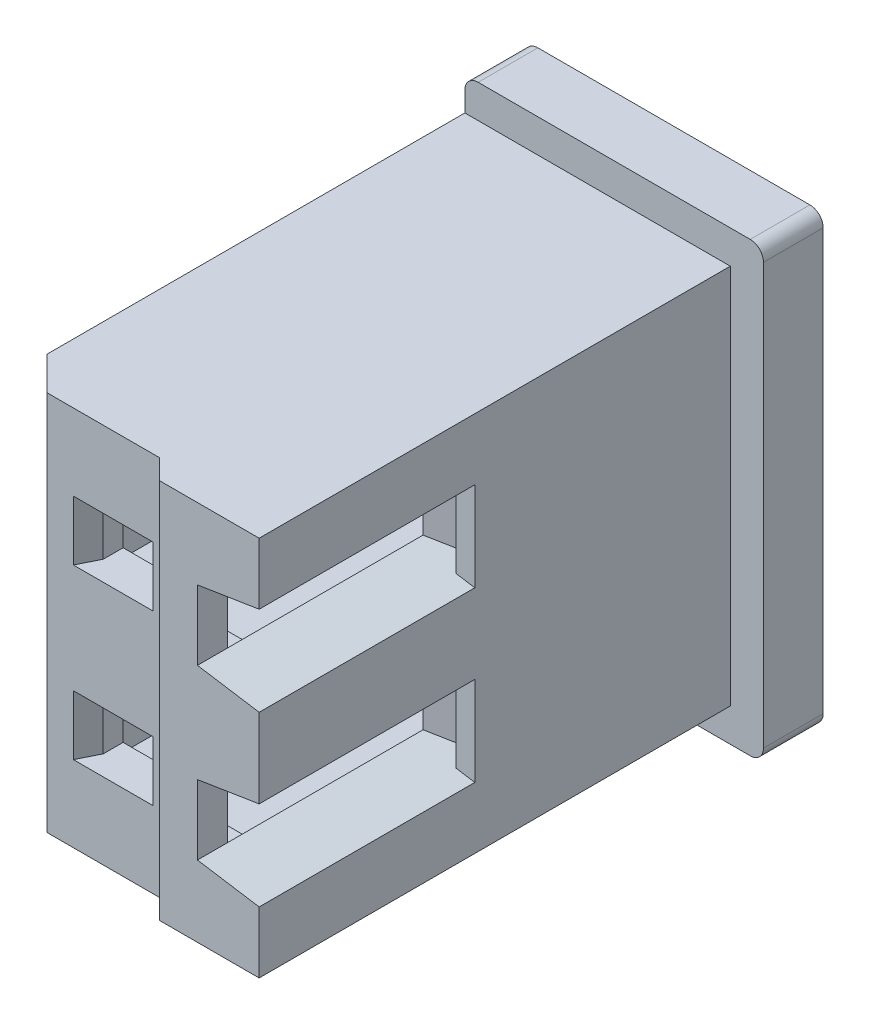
ISO-10303-21;
HEADER;
FILE_DESCRIPTION(('STEP AP214'),'2;1');
FILE_NAME('part.step','',(''),(''),'','','');
FILE_SCHEMA(('AUTOMOTIVE_DESIGN { 1 0 10303 214 1 1 1 1 }'));
ENDSEC;
DATA;
#1=APPLICATION_CONTEXT('core data for automotive mechanical design processes');
#2=APPLICATION_PROTOCOL_DEFINITION('international standard','automotive_design',2000,#1);
#3=PRODUCT_CONTEXT('',#1,'mechanical');
#4=PRODUCT('Part','Part','',(#3));
#5=PRODUCT_RELATED_PRODUCT_CATEGORY('part','',(#4));
#6=PRODUCT_DEFINITION_FORMATION('','',#4);
#7=PRODUCT_DEFINITION_CONTEXT('part definition',#1,'design');
#8=PRODUCT_DEFINITION('design','',#6,#7);
#9=PRODUCT_DEFINITION_SHAPE('','',#8);
#10=(LENGTH_UNIT() NAMED_UNIT(*) SI_UNIT(.MILLI.,.METRE.));
#11=(NAMED_UNIT(*) PLANE_ANGLE_UNIT() SI_UNIT($,.RADIAN.));
#12=(NAMED_UNIT(*) SI_UNIT($,.STERADIAN.) SOLID_ANGLE_UNIT());
#13=UNCERTAINTY_MEASURE_WITH_UNIT(LENGTH_MEASURE(1.E-05),#10,'distance_accuracy_value','');
#14=(GEOMETRIC_REPRESENTATION_CONTEXT(3) GLOBAL_UNCERTAINTY_ASSIGNED_CONTEXT((#13)) GLOBAL_UNIT_ASSIGNED_CONTEXT((#10,
#11,#12)) REPRESENTATION_CONTEXT('',''));
#15=CARTESIAN_POINT('',(0.,0.,0.));
#16=DIRECTION('',(0.,0.,1.));
#17=DIRECTION('',(1.,0.,0.));
#18=AXIS2_PLACEMENT_3D('',#15,#16,#17);
#19=CARTESIAN_POINT('',(0.2,-5.35,4.));
#20=DIRECTION('',(0.,0.,1.));
#21=DIRECTION('',(1.,0.,0.));
#22=AXIS2_PLACEMENT_3D('',#19,#20,#21);
#23=PLANE('',#22);
#24=DIRECTION('',(0.987688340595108,0.156434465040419,0.));
#25=VECTOR('',#24,1.);
#26=CARTESIAN_POINT('',(1.07,1.754750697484,4.));
#27=LINE('',#26,#25);
#28=CARTESIAN_POINT('',(1.07,1.75475069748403,4.));
#29=VERTEX_POINT('',#28);
#30=CARTESIAN_POINT('',(2.,1.90204822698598,4.));
#31=VERTEX_POINT('',#30);
#32=EDGE_CURVE('E1127',#29,#31,#27,.T.);
#33=ORIENTED_EDGE('',*,*,#32,.T.);
#34=DIRECTION('',(0.,1.,0.));
#35=VECTOR('',#34,1.);
#36=CARTESIAN_POINT('',(2.,-5.35,4.));
#37=LINE('',#36,#35);
#38=CARTESIAN_POINT('',(2.,3.09795177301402,4.));
#39=VERTEX_POINT('',#38);
#40=EDGE_CURVE('E1124',#31,#39,#37,.T.);
#41=ORIENTED_EDGE('',*,*,#40,.T.);
#42=DIRECTION('',(-0.987688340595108,0.156434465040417,0.));
#43=VECTOR('',#42,1.);
#44=CARTESIAN_POINT('',(2.,3.097951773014,4.));
#45=LINE('',#44,#43);
#46=CARTESIAN_POINT('',(1.07,3.24524930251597,4.));
#47=VERTEX_POINT('',#46);
#48=EDGE_CURVE('E1154',#39,#47,#45,.T.);
#49=ORIENTED_EDGE('',*,*,#48,.T.);
#50=DIRECTION('',(0.,1.,0.));
#51=VECTOR('',#50,1.);
#52=CARTESIAN_POINT('',(1.07,-5.35,4.));
#53=LINE('',#52,#51);
#54=CARTESIAN_POINT('',(1.07,4.29524930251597,4.));
#55=VERTEX_POINT('',#54);
#56=EDGE_CURVE('E1151',#47,#55,#53,.T.);
#57=ORIENTED_EDGE('',*,*,#56,.T.);
#58=DIRECTION('',(0.987688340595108,0.156434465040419,0.));
#59=VECTOR('',#58,1.);
#60=CARTESIAN_POINT('',(1.07,4.295249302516,4.));
#61=LINE('',#60,#59);
#62=CARTESIAN_POINT('',(2.00000000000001,4.44254683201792,4.));
#63=VERTEX_POINT('',#62);
#64=EDGE_CURVE('E1148',#55,#63,#61,.T.);
#65=ORIENTED_EDGE('',*,*,#64,.T.);
#66=DIRECTION('',(0.,1.,0.));
#67=VECTOR('',#66,1.);
#68=CARTESIAN_POINT('',(2.,-5.35,4.));
#69=LINE('',#68,#67);
#70=CARTESIAN_POINT('',(2.,5.37,4.));
#71=VERTEX_POINT('',#70);
#72=EDGE_CURVE('E1145',#63,#71,#69,.T.);
#73=ORIENTED_EDGE('',*,*,#72,.T.);
#74=DIRECTION('',(1.,0.,0.));
#75=VECTOR('',#74,1.);
#76=CARTESIAN_POINT('',(0.2,5.37,4.));
#77=LINE('',#76,#75);
#78=CARTESIAN_POINT('',(0.5,5.37,4.));
#79=VERTEX_POINT('',#78);
#80=EDGE_CURVE('E1142',#71,#79,#77,.F.);
#81=ORIENTED_EDGE('',*,*,#80,.T.);
#82=DIRECTION('',(0.,1.,0.));
#83=VECTOR('',#82,1.);
#84=CARTESIAN_POINT('',(0.5,0.,4.));
#85=LINE('',#84,#83);
#86=CARTESIAN_POINT('',(0.5,-0.37,4.));
#87=VERTEX_POINT('',#86);
#88=EDGE_CURVE('E1115',#87,#79,#85,.T.);
#89=ORIENTED_EDGE('',*,*,#88,.F.);
#90=DIRECTION('',(1.,0.,0.));
#91=VECTOR('',#90,1.);
#92=CARTESIAN_POINT('',(0.2,-0.37,4.));
#93=LINE('',#92,#91);
#94=CARTESIAN_POINT('',(2.,-0.37,4.));
#95=VERTEX_POINT('',#94);
#96=EDGE_CURVE('E1139',#87,#95,#93,.T.);
#97=ORIENTED_EDGE('',*,*,#96,.T.);
#98=DIRECTION('',(0.,1.,0.));
#99=VECTOR('',#98,1.);
#100=CARTESIAN_POINT('',(2.,-5.35,4.));
#101=LINE('',#100,#99);
#102=CARTESIAN_POINT('',(2.,0.557453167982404,4.));
#103=VERTEX_POINT('',#102);
#104=EDGE_CURVE('E1136',#95,#103,#101,.T.);
#105=ORIENTED_EDGE('',*,*,#104,.T.);
#106=DIRECTION('',(-0.987688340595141,0.156434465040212,0.));
#107=VECTOR('',#106,1.);
#108=CARTESIAN_POINT('',(2.,0.5574531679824,4.));
#109=LINE('',#108,#107);
#110=CARTESIAN_POINT('',(1.07,0.704750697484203,4.));
#111=VERTEX_POINT('',#110);
#112=EDGE_CURVE('E1133',#103,#111,#109,.T.);
#113=ORIENTED_EDGE('',*,*,#112,.T.);
#114=DIRECTION('',(0.,1.,0.));
#115=VECTOR('',#114,1.);
#116=CARTESIAN_POINT('',(1.07,-5.35,4.));
#117=LINE('',#116,#115);
#118=EDGE_CURVE('E1130',#111,#29,#117,.T.);
#119=ORIENTED_EDGE('',*,*,#118,.T.);
#120=EDGE_LOOP('',(#33,#41,#49,#57,#65,#73,#81,#89,#97,#105,#113,#119));
#121=FACE_BOUND('',#120,.T.);
#122=ADVANCED_FACE('F17',(#121),#23,.T.);
#123=CARTESIAN_POINT('',(-0.95,3.3,3.1));
#124=DIRECTION('',(-1.,0.,0.));
#125=DIRECTION('',(0.,0.,1.));
#126=AXIS2_PLACEMENT_3D('',#123,#124,#125);
#127=PLANE('',#126);
#128=DIRECTION('',(0.,1.,0.));
#129=VECTOR('',#128,1.);
#130=CARTESIAN_POINT('',(-0.95,2.7,3.1));
#131=LINE('',#130,#129);
#132=CARTESIAN_POINT('',(-0.95,3.32,3.1));
#133=VERTEX_POINT('',#132);
#134=CARTESIAN_POINT('',(-0.95,4.22,3.1));
#135=VERTEX_POINT('',#134);
#136=EDGE_CURVE('E1052',#133,#135,#131,.T.);
#137=ORIENTED_EDGE('',*,*,#136,.T.);
#138=DIRECTION('',(0.,0.,1.));
#139=VECTOR('',#138,1.);
#140=CARTESIAN_POINT('',(-0.95,4.22,0.));
#141=LINE('',#140,#139);
#142=CARTESIAN_POINT('',(-0.949999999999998,4.22,3.4));
#143=VERTEX_POINT('',#142);
#144=EDGE_CURVE('E1078',#135,#143,#141,.T.);
#145=ORIENTED_EDGE('',*,*,#144,.T.);
#146=DIRECTION('',(0.,1.,0.));
#147=VECTOR('',#146,1.);
#148=CARTESIAN_POINT('',(-0.949999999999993,3.75,3.4));
#149=LINE('',#148,#147);
#150=CARTESIAN_POINT('',(-0.949999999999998,3.32,3.4));
#151=VERTEX_POINT('',#150);
#152=EDGE_CURVE('E1083',#151,#143,#149,.T.);
#153=ORIENTED_EDGE('',*,*,#152,.F.);
#154=DIRECTION('',(0.,0.,1.));
#155=VECTOR('',#154,1.);
#156=CARTESIAN_POINT('',(-0.95,3.32,0.));
#157=LINE('',#156,#155);
#158=EDGE_CURVE('E1088',#133,#151,#157,.T.);
#159=ORIENTED_EDGE('',*,*,#158,.F.);
#160=EDGE_LOOP('',(#137,#145,#153,#159));
#161=FACE_BOUND('',#160,.T.);
#162=ADVANCED_FACE('F2068',(#161),#127,.F.);
#163=CARTESIAN_POINT('',(-0.05,3.3,3.7));
#164=DIRECTION('',(1.,0.,0.));
#165=DIRECTION('',(0.,0.,-1.));
#166=AXIS2_PLACEMENT_3D('',#163,#164,#165);
#167=PLANE('',#166);
#168=DIRECTION('',(0.,1.,0.));
#169=VECTOR('',#168,1.);
#170=CARTESIAN_POINT('',(-0.0499999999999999,2.7,3.1));
#171=LINE('',#170,#169);
#172=CARTESIAN_POINT('',(-0.05,4.22,3.1));
#173=VERTEX_POINT('',#172);
#174=CARTESIAN_POINT('',(-0.05,3.32,3.1));
#175=VERTEX_POINT('',#174);
#176=EDGE_CURVE('E1046',#173,#175,#171,.F.);
#177=ORIENTED_EDGE('',*,*,#176,.T.);
#178=DIRECTION('',(0.,0.,1.));
#179=VECTOR('',#178,1.);
#180=CARTESIAN_POINT('',(-0.05,3.32,0.));
#181=LINE('',#180,#179);
#182=CARTESIAN_POINT('',(-0.0500000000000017,3.32,3.4));
#183=VERTEX_POINT('',#182);
#184=EDGE_CURVE('E1086',#183,#175,#181,.F.);
#185=ORIENTED_EDGE('',*,*,#184,.F.);
#186=DIRECTION('',(0.,1.,0.));
#187=VECTOR('',#186,1.);
#188=CARTESIAN_POINT('',(-0.0500000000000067,3.75,3.4));
#189=LINE('',#188,#187);
#190=CARTESIAN_POINT('',(-0.0500000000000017,4.22,3.4));
#191=VERTEX_POINT('',#190);
#192=EDGE_CURVE('E1068',#191,#183,#189,.F.);
#193=ORIENTED_EDGE('',*,*,#192,.F.);
#194=DIRECTION('',(0.,0.,1.));
#195=VECTOR('',#194,1.);
#196=CARTESIAN_POINT('',(-0.05,4.22,0.));
#197=LINE('',#196,#195);
#198=EDGE_CURVE('E1074',#191,#173,#197,.F.);
#199=ORIENTED_EDGE('',*,*,#198,.T.);
#200=EDGE_LOOP('',(#177,#185,#193,#199));
#201=FACE_BOUND('',#200,.T.);
#202=ADVANCED_FACE('F2059',(#201),#167,.F.);
#203=CARTESIAN_POINT('',(-0.95,1.7,3.1));
#204=DIRECTION('',(1.,0.,0.));
#205=DIRECTION('',(0.,0.,-1.));
#206=AXIS2_PLACEMENT_3D('',#203,#204,#205);
#207=PLANE('',#206);
#208=DIRECTION('',(0.,0.,1.));
#209=VECTOR('',#208,1.);
#210=CARTESIAN_POINT('',(-0.95,1.68,0.));
#211=LINE('',#210,#209);
#212=CARTESIAN_POINT('',(-0.95,1.68,3.1));
#213=VERTEX_POINT('',#212);
#214=CARTESIAN_POINT('',(-0.949999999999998,1.68,3.4));
#215=VERTEX_POINT('',#214);
#216=EDGE_CURVE('E1113',#213,#215,#211,.T.);
#217=ORIENTED_EDGE('',*,*,#216,.T.);
#218=DIRECTION('',(0.,1.,0.));
#219=VECTOR('',#218,1.);
#220=CARTESIAN_POINT('',(-0.949999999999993,1.25,3.4));
#221=LINE('',#220,#219);
#222=CARTESIAN_POINT('',(-0.949999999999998,0.78,3.4));
#223=VERTEX_POINT('',#222);
#224=EDGE_CURVE('E1093',#215,#223,#221,.F.);
#225=ORIENTED_EDGE('',*,*,#224,.T.);
#226=DIRECTION('',(0.,0.,1.));
#227=VECTOR('',#226,1.);
#228=CARTESIAN_POINT('',(-0.95,0.78,0.));
#229=LINE('',#228,#227);
#230=CARTESIAN_POINT('',(-0.95,0.78,3.1));
#231=VERTEX_POINT('',#230);
#232=EDGE_CURVE('E1103',#231,#223,#229,.T.);
#233=ORIENTED_EDGE('',*,*,#232,.F.);
#234=DIRECTION('',(0.,1.,0.));
#235=VECTOR('',#234,1.);
#236=CARTESIAN_POINT('',(-0.95,2.3,3.1));
#237=LINE('',#236,#235);
#238=EDGE_CURVE('E1032',#213,#231,#237,.F.);
#239=ORIENTED_EDGE('',*,*,#238,.F.);
#240=EDGE_LOOP('',(#217,#225,#233,#239));
#241=FACE_BOUND('',#240,.T.);
#242=ADVANCED_FACE('F2050',(#241),#207,.T.);
#243=CARTESIAN_POINT('',(-0.05,1.7,3.7));
#244=DIRECTION('',(-1.,0.,0.));
#245=DIRECTION('',(0.,0.,1.));
#246=AXIS2_PLACEMENT_3D('',#243,#244,#245);
#247=PLANE('',#246);
#248=DIRECTION('',(0.,0.,1.));
#249=VECTOR('',#248,1.);
#250=CARTESIAN_POINT('',(-0.05,0.78,0.));
#251=LINE('',#250,#249);
#252=CARTESIAN_POINT('',(-0.0500000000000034,0.78,3.4));
#253=VERTEX_POINT('',#252);
#254=CARTESIAN_POINT('',(-0.05,0.78,3.1));
#255=VERTEX_POINT('',#254);
#256=EDGE_CURVE('E1098',#253,#255,#251,.F.);
#257=ORIENTED_EDGE('',*,*,#256,.F.);
#258=DIRECTION('',(0.,1.,0.));
#259=VECTOR('',#258,1.);
#260=CARTESIAN_POINT('',(-0.0500000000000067,1.25,3.4));
#261=LINE('',#260,#259);
#262=CARTESIAN_POINT('',(-0.0500000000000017,1.68,3.4));
#263=VERTEX_POINT('',#262);
#264=EDGE_CURVE('E1106',#253,#263,#261,.T.);
#265=ORIENTED_EDGE('',*,*,#264,.T.);
#266=DIRECTION('',(0.,0.,1.));
#267=VECTOR('',#266,1.);
#268=CARTESIAN_POINT('',(-0.05,1.68,0.));
#269=LINE('',#268,#267);
#270=CARTESIAN_POINT('',(-0.05,1.68,3.1));
#271=VERTEX_POINT('',#270);
#272=EDGE_CURVE('E1111',#263,#271,#269,.F.);
#273=ORIENTED_EDGE('',*,*,#272,.T.);
#274=DIRECTION('',(0.,1.,0.));
#275=VECTOR('',#274,1.);
#276=CARTESIAN_POINT('',(-0.0499999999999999,2.3,3.1));
#277=LINE('',#276,#275);
#278=EDGE_CURVE('E1026',#255,#271,#277,.T.);
#279=ORIENTED_EDGE('',*,*,#278,.F.);
#280=EDGE_LOOP('',(#257,#265,#273,#279));
#281=FACE_BOUND('',#280,.T.);
#282=ADVANCED_FACE('F2041',(#281),#247,.T.);
#283=CARTESIAN_POINT('',(0.35,0.,3.85));
#284=DIRECTION('',(-0.707106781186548,0.,0.707106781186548));
#285=DIRECTION('',(0.707106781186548,0.,0.707106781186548));
#286=AXIS2_PLACEMENT_3D('',#283,#284,#285);
#287=PLANE('',#286);
#288=DIRECTION('',(0.707106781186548,0.,0.707106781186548));
#289=VECTOR('',#288,1.);
#290=CARTESIAN_POINT('',(0.35,-0.37,3.85));
#291=LINE('',#290,#289);
#292=CARTESIAN_POINT('',(0.2,-0.37,3.7));
#293=VERTEX_POINT('',#292);
#294=EDGE_CURVE('E1118',#293,#87,#291,.T.);
#295=ORIENTED_EDGE('',*,*,#294,.T.);
#296=ORIENTED_EDGE('',*,*,#88,.T.);
#297=DIRECTION('',(0.707106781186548,0.,0.707106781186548));
#298=VECTOR('',#297,1.);
#299=CARTESIAN_POINT('',(0.35,5.37,3.85));
#300=LINE('',#299,#298);
#301=CARTESIAN_POINT('',(0.2,5.37,3.7));
#302=VERTEX_POINT('',#301);
#303=EDGE_CURVE('E1121',#79,#302,#300,.F.);
#304=ORIENTED_EDGE('',*,*,#303,.T.);
#305=DIRECTION('',(0.,1.,0.));
#306=VECTOR('',#305,1.);
#307=CARTESIAN_POINT('',(0.2,-5.35,3.7));
#308=LINE('',#307,#306);
#309=EDGE_CURVE('E974',#293,#302,#308,.T.);
#310=ORIENTED_EDGE('',*,*,#309,.F.);
#311=EDGE_LOOP('',(#295,#296,#304,#310));
#312=FACE_BOUND('',#311,.T.);
#313=ADVANCED_FACE('F2032',(#312),#287,.T.);
#314=CARTESIAN_POINT('',(0.,1.68,0.));
#315=DIRECTION('',(0.,1.,0.));
#316=DIRECTION('',(0.,0.,1.));
#317=AXIS2_PLACEMENT_3D('',#314,#315,#316);
#318=PLANE('',#317);
#319=ORIENTED_EDGE('',*,*,#272,.F.);
#320=DIRECTION('',(-0.447213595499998,0.,-0.894427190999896));
#321=VECTOR('',#320,1.);
#322=CARTESIAN_POINT('',(0.025,1.68,3.55));
#323=LINE('',#322,#321);
#324=CARTESIAN_POINT('',(0.100000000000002,1.68,3.7));
#325=VERTEX_POINT('',#324);
#326=EDGE_CURVE('E1109',#263,#325,#323,.F.);
#327=ORIENTED_EDGE('',*,*,#326,.T.);
#328=DIRECTION('',(1.,0.,0.));
#329=VECTOR('',#328,1.);
#330=CARTESIAN_POINT('',(-2.,1.68,3.7));
#331=LINE('',#330,#329);
#332=CARTESIAN_POINT('',(-1.1,1.68,3.7));
#333=VERTEX_POINT('',#332);
#334=EDGE_CURVE('E971',#333,#325,#331,.T.);
#335=ORIENTED_EDGE('',*,*,#334,.F.);
#336=DIRECTION('',(-0.447213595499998,0.,0.894427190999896));
#337=VECTOR('',#336,1.);
#338=CARTESIAN_POINT('',(-1.025,1.68,3.55));
#339=LINE('',#338,#337);
#340=EDGE_CURVE('E1095',#333,#215,#339,.F.);
#341=ORIENTED_EDGE('',*,*,#340,.T.);
#342=ORIENTED_EDGE('',*,*,#216,.F.);
#343=DIRECTION('',(-1.,0.,0.));
#344=VECTOR('',#343,1.);
#345=CARTESIAN_POINT('',(-1.42,1.68,3.1));
#346=LINE('',#345,#344);
#347=EDGE_CURVE('E1023',#271,#213,#346,.T.);
#348=ORIENTED_EDGE('',*,*,#347,.F.);
#349=EDGE_LOOP('',(#319,#327,#335,#341,#342,#348));
#350=FACE_BOUND('',#349,.T.);
#351=ADVANCED_FACE('F2023',(#350),#318,.F.);
#352=CARTESIAN_POINT('',(0.025,1.25,3.55));
#353=DIRECTION('',(0.894427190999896,0.,-0.447213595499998));
#354=DIRECTION('',(-0.447213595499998,0.,-0.894427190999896));
#355=AXIS2_PLACEMENT_3D('',#352,#353,#354);
#356=PLANE('',#355);
#357=DIRECTION('',(-0.447213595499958,0.,-0.894427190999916));
#358=VECTOR('',#357,1.);
#359=CARTESIAN_POINT('',(0.1,0.78,3.7));
#360=LINE('',#359,#358);
#361=CARTESIAN_POINT('',(0.100000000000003,0.78,3.7));
#362=VERTEX_POINT('',#361);
#363=EDGE_CURVE('E1100',#362,#253,#360,.T.);
#364=ORIENTED_EDGE('',*,*,#363,.F.);
#365=DIRECTION('',(0.,1.,0.));
#366=VECTOR('',#365,1.);
#367=CARTESIAN_POINT('',(0.0999999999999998,-5.35,3.7));
#368=LINE('',#367,#366);
#369=EDGE_CURVE('E968',#325,#362,#368,.F.);
#370=ORIENTED_EDGE('',*,*,#369,.F.);
#371=ORIENTED_EDGE('',*,*,#326,.F.);
#372=ORIENTED_EDGE('',*,*,#264,.F.);
#373=EDGE_LOOP('',(#364,#370,#371,#372));
#374=FACE_BOUND('',#373,.T.);
#375=ADVANCED_FACE('F2014',(#374),#356,.F.);
#376=CARTESIAN_POINT('',(0.,0.78,0.));
#377=DIRECTION('',(0.,1.,0.));
#378=DIRECTION('',(0.,0.,1.));
#379=AXIS2_PLACEMENT_3D('',#376,#377,#378);
#380=PLANE('',#379);
#381=ORIENTED_EDGE('',*,*,#363,.T.);
#382=ORIENTED_EDGE('',*,*,#256,.T.);
#383=DIRECTION('',(-1.,0.,0.));
#384=VECTOR('',#383,1.);
#385=CARTESIAN_POINT('',(-1.42,0.78,3.1));
#386=LINE('',#385,#384);
#387=EDGE_CURVE('E1029',#231,#255,#386,.F.);
#388=ORIENTED_EDGE('',*,*,#387,.F.);
#389=ORIENTED_EDGE('',*,*,#232,.T.);
#390=DIRECTION('',(-0.447213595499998,0.,0.894427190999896));
#391=VECTOR('',#390,1.);
#392=CARTESIAN_POINT('',(-1.025,0.78,3.55));
#393=LINE('',#392,#391);
#394=CARTESIAN_POINT('',(-1.1,0.78,3.7));
#395=VERTEX_POINT('',#394);
#396=EDGE_CURVE('E1091',#223,#395,#393,.T.);
#397=ORIENTED_EDGE('',*,*,#396,.T.);
#398=DIRECTION('',(1.,0.,0.));
#399=VECTOR('',#398,1.);
#400=CARTESIAN_POINT('',(-2.,0.78,3.7));
#401=LINE('',#400,#399);
#402=EDGE_CURVE('E965',#362,#395,#401,.F.);
#403=ORIENTED_EDGE('',*,*,#402,.F.);
#404=EDGE_LOOP('',(#381,#382,#388,#389,#397,#403));
#405=FACE_BOUND('',#404,.T.);
#406=ADVANCED_FACE('F2005',(#405),#380,.T.);
#407=CARTESIAN_POINT('',(-1.025,1.25,3.55));
#408=DIRECTION('',(-0.894427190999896,0.,-0.447213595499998));
#409=DIRECTION('',(-0.447213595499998,0.,0.894427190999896));
#410=AXIS2_PLACEMENT_3D('',#407,#408,#409);
#411=PLANE('',#410);
#412=ORIENTED_EDGE('',*,*,#396,.F.);
#413=ORIENTED_EDGE('',*,*,#224,.F.);
#414=ORIENTED_EDGE('',*,*,#340,.F.);
#415=DIRECTION('',(0.,1.,0.));
#416=VECTOR('',#415,1.);
#417=CARTESIAN_POINT('',(-1.1,-5.35,3.7));
#418=LINE('',#417,#416);
#419=EDGE_CURVE('E962',#395,#333,#418,.T.);
#420=ORIENTED_EDGE('',*,*,#419,.F.);
#421=EDGE_LOOP('',(#412,#413,#414,#420));
#422=FACE_BOUND('',#421,.T.);
#423=ADVANCED_FACE('F1996',(#422),#411,.F.);
#424=CARTESIAN_POINT('',(0.,3.32,0.));
#425=DIRECTION('',(0.,1.,0.));
#426=DIRECTION('',(0.,0.,1.));
#427=AXIS2_PLACEMENT_3D('',#424,#425,#426);
#428=PLANE('',#427);
#429=DIRECTION('',(0.447213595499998,0.,0.894427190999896));
#430=VECTOR('',#429,1.);
#431=CARTESIAN_POINT('',(0.025,3.32,3.55));
#432=LINE('',#431,#430);
#433=CARTESIAN_POINT('',(0.100000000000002,3.32,3.7));
#434=VERTEX_POINT('',#433);
#435=EDGE_CURVE('E1065',#183,#434,#432,.T.);
#436=ORIENTED_EDGE('',*,*,#435,.F.);
#437=ORIENTED_EDGE('',*,*,#184,.T.);
#438=DIRECTION('',(1.,0.,0.));
#439=VECTOR('',#438,1.);
#440=CARTESIAN_POINT('',(-1.42,3.32,3.1));
#441=LINE('',#440,#439);
#442=EDGE_CURVE('E1054',#175,#133,#441,.F.);
#443=ORIENTED_EDGE('',*,*,#442,.T.);
#444=ORIENTED_EDGE('',*,*,#158,.T.);
#445=DIRECTION('',(0.447213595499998,0.,-0.894427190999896));
#446=VECTOR('',#445,1.);
#447=CARTESIAN_POINT('',(-1.025,3.32,3.55));
#448=LINE('',#447,#446);
#449=CARTESIAN_POINT('',(-1.1,3.32,3.7));
#450=VERTEX_POINT('',#449);
#451=EDGE_CURVE('E1080',#450,#151,#448,.T.);
#452=ORIENTED_EDGE('',*,*,#451,.F.);
#453=DIRECTION('',(1.,0.,0.));
#454=VECTOR('',#453,1.);
#455=CARTESIAN_POINT('',(-2.,3.32,3.7));
#456=LINE('',#455,#454);
#457=EDGE_CURVE('E959',#434,#450,#456,.F.);
#458=ORIENTED_EDGE('',*,*,#457,.F.);
#459=EDGE_LOOP('',(#436,#437,#443,#444,#452,#458));
#460=FACE_BOUND('',#459,.T.);
#461=ADVANCED_FACE('F1987',(#460),#428,.T.);
#462=CARTESIAN_POINT('',(-1.025,3.75,3.55));
#463=DIRECTION('',(0.894427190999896,0.,0.447213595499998));
#464=DIRECTION('',(0.447213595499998,0.,-0.894427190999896));
#465=AXIS2_PLACEMENT_3D('',#462,#463,#464);
#466=PLANE('',#465);
#467=DIRECTION('',(0.,1.,0.));
#468=VECTOR('',#467,1.);
#469=CARTESIAN_POINT('',(-1.1,-5.35,3.7));
#470=LINE('',#469,#468);
#471=CARTESIAN_POINT('',(-1.1,4.22,3.7));
#472=VERTEX_POINT('',#471);
#473=EDGE_CURVE('E956',#450,#472,#470,.T.);
#474=ORIENTED_EDGE('',*,*,#473,.F.);
#475=ORIENTED_EDGE('',*,*,#451,.T.);
#476=ORIENTED_EDGE('',*,*,#152,.T.);
#477=DIRECTION('',(-0.447213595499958,0.,0.894427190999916));
#478=VECTOR('',#477,1.);
#479=CARTESIAN_POINT('',(-0.95,4.22,3.4));
#480=LINE('',#479,#478);
#481=EDGE_CURVE('E1076',#143,#472,#480,.T.);
#482=ORIENTED_EDGE('',*,*,#481,.T.);
#483=EDGE_LOOP('',(#474,#475,#476,#482));
#484=FACE_BOUND('',#483,.T.);
#485=ADVANCED_FACE('F1978',(#484),#466,.T.);
#486=CARTESIAN_POINT('',(0.,4.22,0.));
#487=DIRECTION('',(0.,1.,0.));
#488=DIRECTION('',(0.,0.,1.));
#489=AXIS2_PLACEMENT_3D('',#486,#487,#488);
#490=PLANE('',#489);
#491=ORIENTED_EDGE('',*,*,#198,.F.);
#492=DIRECTION('',(0.447213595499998,0.,0.894427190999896));
#493=VECTOR('',#492,1.);
#494=CARTESIAN_POINT('',(0.025,4.22,3.55));
#495=LINE('',#494,#493);
#496=CARTESIAN_POINT('',(0.100000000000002,4.22,3.7));
#497=VERTEX_POINT('',#496);
#498=EDGE_CURVE('E1071',#497,#191,#495,.F.);
#499=ORIENTED_EDGE('',*,*,#498,.F.);
#500=DIRECTION('',(1.,0.,0.));
#501=VECTOR('',#500,1.);
#502=CARTESIAN_POINT('',(-2.,4.22,3.7));
#503=LINE('',#502,#501);
#504=EDGE_CURVE('E953',#472,#497,#503,.T.);
#505=ORIENTED_EDGE('',*,*,#504,.F.);
#506=ORIENTED_EDGE('',*,*,#481,.F.);
#507=ORIENTED_EDGE('',*,*,#144,.F.);
#508=DIRECTION('',(1.,0.,0.));
#509=VECTOR('',#508,1.);
#510=CARTESIAN_POINT('',(-1.42,4.22,3.1));
#511=LINE('',#510,#509);
#512=EDGE_CURVE('E1049',#135,#173,#511,.T.);
#513=ORIENTED_EDGE('',*,*,#512,.T.);
#514=EDGE_LOOP('',(#491,#499,#505,#506,#507,#513));
#515=FACE_BOUND('',#514,.T.);
#516=ADVANCED_FACE('F1969',(#515),#490,.F.);
#517=CARTESIAN_POINT('',(0.025,3.75,3.55));
#518=DIRECTION('',(-0.894427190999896,0.,0.447213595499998));
#519=DIRECTION('',(0.447213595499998,0.,0.894427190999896));
#520=AXIS2_PLACEMENT_3D('',#517,#518,#519);
#521=PLANE('',#520);
#522=ORIENTED_EDGE('',*,*,#192,.T.);
#523=ORIENTED_EDGE('',*,*,#435,.T.);
#524=DIRECTION('',(0.,1.,0.));
#525=VECTOR('',#524,1.);
#526=CARTESIAN_POINT('',(0.0999999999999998,-5.35,3.7));
#527=LINE('',#526,#525);
#528=EDGE_CURVE('E939',#497,#434,#527,.F.);
#529=ORIENTED_EDGE('',*,*,#528,.F.);
#530=ORIENTED_EDGE('',*,*,#498,.T.);
#531=EDGE_LOOP('',(#522,#523,#529,#530));
#532=FACE_BOUND('',#531,.T.);
#533=ADVANCED_FACE('F1960',(#532),#521,.T.);
#534=CARTESIAN_POINT('',(1.52,3.25,-1.));
#535=DIRECTION('',(1.,0.,0.));
#536=DIRECTION('',(0.,0.,-1.));
#537=AXIS2_PLACEMENT_3D('',#534,#535,#536);
#538=PLANE('',#537);
#539=DIRECTION('',(0.,1.,0.));
#540=VECTOR('',#539,1.);
#541=CARTESIAN_POINT('',(1.52000000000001,3.25,-0.999999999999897));
#542=LINE('',#541,#540);
#543=CARTESIAN_POINT('',(1.52,3.27,-0.999999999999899));
#544=VERTEX_POINT('',#543);
#545=CARTESIAN_POINT('',(1.52,4.27,-0.999999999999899));
#546=VERTEX_POINT('',#545);
#547=EDGE_CURVE('E915',#544,#546,#542,.T.);
#548=ORIENTED_EDGE('',*,*,#547,.T.);
#549=DIRECTION('',(0.,0.,1.));
#550=VECTOR('',#549,1.);
#551=CARTESIAN_POINT('',(1.52,4.27,0.));
#552=LINE('',#551,#550);
#553=CARTESIAN_POINT('',(1.52,4.27,-4.));
#554=VERTEX_POINT('',#553);
#555=EDGE_CURVE('E909',#546,#554,#552,.F.);
#556=ORIENTED_EDGE('',*,*,#555,.T.);
#557=DIRECTION('',(0.,1.,0.));
#558=VECTOR('',#557,1.);
#559=CARTESIAN_POINT('',(1.52,3.25,-4.));
#560=LINE('',#559,#558);
#561=CARTESIAN_POINT('',(1.52,3.27,-4.));
#562=VERTEX_POINT('',#561);
#563=EDGE_CURVE('E1063',#562,#554,#560,.T.);
#564=ORIENTED_EDGE('',*,*,#563,.F.);
#565=DIRECTION('',(0.,0.,1.));
#566=VECTOR('',#565,1.);
#567=CARTESIAN_POINT('',(1.52,3.27,0.));
#568=LINE('',#567,#566);
#569=EDGE_CURVE('E920',#544,#562,#568,.F.);
#570=ORIENTED_EDGE('',*,*,#569,.F.);
#571=EDGE_LOOP('',(#548,#556,#564,#570));
#572=FACE_BOUND('',#571,.T.);
#573=ADVANCED_FACE('F1951',(#572),#538,.F.);
#574=CARTESIAN_POINT('',(-1.42,2.7,3.1));
#575=DIRECTION('',(0.,0.,1.));
#576=DIRECTION('',(1.,0.,0.));
#577=AXIS2_PLACEMENT_3D('',#574,#575,#576);
#578=PLANE('',#577);
#579=ORIENTED_EDGE('',*,*,#512,.F.);
#580=ORIENTED_EDGE('',*,*,#136,.F.);
#581=ORIENTED_EDGE('',*,*,#442,.F.);
#582=ORIENTED_EDGE('',*,*,#176,.F.);
#583=EDGE_LOOP('',(#579,#580,#581,#582));
#584=FACE_BOUND('',#583,.T.);
#585=DIRECTION('',(1.,0.,0.));
#586=VECTOR('',#585,1.);
#587=CARTESIAN_POINT('',(0.,4.82,3.1));
#588=LINE('',#587,#586);
#589=CARTESIAN_POINT('',(-1.42,4.82,3.1));
#590=VERTEX_POINT('',#589);
#591=CARTESIAN_POINT('',(1.07,4.82,3.1));
#592=VERTEX_POINT('',#591);
#593=EDGE_CURVE('E906',#590,#592,#588,.T.);
#594=ORIENTED_EDGE('',*,*,#593,.T.);
#595=DIRECTION('',(0.,1.,0.));
#596=VECTOR('',#595,1.);
#597=CARTESIAN_POINT('',(1.07,2.7,3.1));
#598=LINE('',#597,#596);
#599=CARTESIAN_POINT('',(1.07,4.52,3.1));
#600=VERTEX_POINT('',#599);
#601=EDGE_CURVE('E1057',#600,#592,#598,.T.);
#602=ORIENTED_EDGE('',*,*,#601,.F.);
#603=DIRECTION('',(1.,0.,0.));
#604=VECTOR('',#603,1.);
#605=CARTESIAN_POINT('',(-1.42,4.52,3.1));
#606=LINE('',#605,#604);
#607=CARTESIAN_POINT('',(0.0101219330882,4.52,3.1));
#608=VERTEX_POINT('',#607);
#609=EDGE_CURVE('E1059',#608,#600,#606,.T.);
#610=ORIENTED_EDGE('',*,*,#609,.F.);
#611=DIRECTION('',(0.,1.,0.));
#612=VECTOR('',#611,1.);
#613=CARTESIAN_POINT('',(0.0101219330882,2.7,3.1));
#614=LINE('',#613,#612);
#615=CARTESIAN_POINT('',(0.0101219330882,3.02,3.1));
#616=VERTEX_POINT('',#615);
#617=EDGE_CURVE('E1044',#608,#616,#614,.F.);
#618=ORIENTED_EDGE('',*,*,#617,.T.);
#619=DIRECTION('',(1.,0.,0.));
#620=VECTOR('',#619,1.);
#621=CARTESIAN_POINT('',(0.,3.02,3.1));
#622=LINE('',#621,#620);
#623=CARTESIAN_POINT('',(1.07,3.02,3.1));
#624=VERTEX_POINT('',#623);
#625=EDGE_CURVE('E932',#616,#624,#622,.T.);
#626=ORIENTED_EDGE('',*,*,#625,.T.);
#627=DIRECTION('',(0.,1.,0.));
#628=VECTOR('',#627,1.);
#629=CARTESIAN_POINT('',(1.07,2.7,3.1));
#630=LINE('',#629,#628);
#631=CARTESIAN_POINT('',(1.07,2.72,3.1));
#632=VERTEX_POINT('',#631);
#633=EDGE_CURVE('E1061',#632,#624,#630,.T.);
#634=ORIENTED_EDGE('',*,*,#633,.F.);
#635=DIRECTION('',(1.,0.,0.));
#636=VECTOR('',#635,1.);
#637=CARTESIAN_POINT('',(0.,2.72,3.1));
#638=LINE('',#637,#636);
#639=CARTESIAN_POINT('',(-1.42,2.72,3.1));
#640=VERTEX_POINT('',#639);
#641=EDGE_CURVE('E923',#640,#632,#638,.T.);
#642=ORIENTED_EDGE('',*,*,#641,.F.);
#643=DIRECTION('',(0.,1.,0.));
#644=VECTOR('',#643,1.);
#645=CARTESIAN_POINT('',(-1.42,2.7,3.1));
#646=LINE('',#645,#644);
#647=EDGE_CURVE('E937',#640,#590,#646,.T.);
#648=ORIENTED_EDGE('',*,*,#647,.T.);
#649=EDGE_LOOP('',(#594,#602,#610,#618,#626,#634,#642,#648));
#650=FACE_BOUND('',#649,.T.);
#651=ADVANCED_FACE('F1320',(#584,#650),#578,.F.);
#652=CARTESIAN_POINT('',(0.0101219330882,2.7,3.1));
#653=DIRECTION('',(-0.707106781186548,0.,0.707106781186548));
#654=DIRECTION('',(0.707106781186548,0.,0.707106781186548));
#655=AXIS2_PLACEMENT_3D('',#652,#653,#654);
#656=PLANE('',#655);
#657=DIRECTION('',(-0.707106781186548,0.,-0.707106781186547));
#658=VECTOR('',#657,1.);
#659=CARTESIAN_POINT('',(0.4601219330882,4.52,3.55));
#660=LINE('',#659,#658);
#661=CARTESIAN_POINT('',(0.4601219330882,4.52,3.55));
#662=VERTEX_POINT('',#661);
#663=EDGE_CURVE('E900',#662,#608,#660,.T.);
#664=ORIENTED_EDGE('',*,*,#663,.F.);
#665=DIRECTION('',(0.,1.,0.));
#666=VECTOR('',#665,1.);
#667=CARTESIAN_POINT('',(0.4601219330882,2.7,3.55));
#668=LINE('',#667,#666);
#669=CARTESIAN_POINT('',(0.4601219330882,3.02,3.55));
#670=VERTEX_POINT('',#669);
#671=EDGE_CURVE('E895',#662,#670,#668,.F.);
#672=ORIENTED_EDGE('',*,*,#671,.T.);
#673=DIRECTION('',(-0.707106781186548,0.,-0.707106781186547));
#674=VECTOR('',#673,1.);
#675=CARTESIAN_POINT('',(0.4601219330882,3.02,3.55));
#676=LINE('',#675,#674);
#677=EDGE_CURVE('E929',#670,#616,#676,.T.);
#678=ORIENTED_EDGE('',*,*,#677,.T.);
#679=ORIENTED_EDGE('',*,*,#617,.F.);
#680=EDGE_LOOP('',(#664,#672,#678,#679));
#681=FACE_BOUND('',#680,.T.);
#682=ADVANCED_FACE('F1313',(#681),#656,.F.);
#683=CARTESIAN_POINT('',(1.52,1.75,-1.));
#684=DIRECTION('',(-1.,0.,0.));
#685=DIRECTION('',(0.,0.,1.));
#686=AXIS2_PLACEMENT_3D('',#683,#684,#685);
#687=PLANE('',#686);
#688=DIRECTION('',(0.,0.,1.));
#689=VECTOR('',#688,1.);
#690=CARTESIAN_POINT('',(1.52,1.73,0.));
#691=LINE('',#690,#689);
#692=CARTESIAN_POINT('',(1.52,1.73,-0.999999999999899));
#693=VERTEX_POINT('',#692);
#694=CARTESIAN_POINT('',(1.52,1.73,-4.));
#695=VERTEX_POINT('',#694);
#696=EDGE_CURVE('E878',#693,#695,#691,.F.);
#697=ORIENTED_EDGE('',*,*,#696,.T.);
#698=DIRECTION('',(0.,1.,0.));
#699=VECTOR('',#698,1.);
#700=CARTESIAN_POINT('',(1.52,1.75,-4.));
#701=LINE('',#700,#699);
#702=CARTESIAN_POINT('',(1.52,0.73,-4.));
#703=VERTEX_POINT('',#702);
#704=EDGE_CURVE('E1042',#695,#703,#701,.F.);
#705=ORIENTED_EDGE('',*,*,#704,.T.);
#706=DIRECTION('',(0.,0.,1.));
#707=VECTOR('',#706,1.);
#708=CARTESIAN_POINT('',(1.52,0.73,0.));
#709=LINE('',#708,#707);
#710=CARTESIAN_POINT('',(1.52,0.73,-0.999999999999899));
#711=VERTEX_POINT('',#710);
#712=EDGE_CURVE('E867',#711,#703,#709,.F.);
#713=ORIENTED_EDGE('',*,*,#712,.F.);
#714=DIRECTION('',(0.,1.,0.));
#715=VECTOR('',#714,1.);
#716=CARTESIAN_POINT('',(1.52000000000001,1.75,-0.999999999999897));
#717=LINE('',#716,#715);
#718=EDGE_CURVE('E873',#693,#711,#717,.F.);
#719=ORIENTED_EDGE('',*,*,#718,.F.);
#720=EDGE_LOOP('',(#697,#705,#713,#719));
#721=FACE_BOUND('',#720,.T.);
#722=ADVANCED_FACE('F1927',(#721),#687,.T.);
#723=CARTESIAN_POINT('',(-1.42,2.3,3.1));
#724=DIRECTION('',(0.,0.,-1.));
#725=DIRECTION('',(-1.,0.,0.));
#726=AXIS2_PLACEMENT_3D('',#723,#724,#725);
#727=PLANE('',#726);
#728=ORIENTED_EDGE('',*,*,#278,.T.);
#729=ORIENTED_EDGE('',*,*,#347,.T.);
#730=ORIENTED_EDGE('',*,*,#238,.T.);
#731=ORIENTED_EDGE('',*,*,#387,.T.);
#732=EDGE_LOOP('',(#728,#729,#730,#731));
#733=FACE_BOUND('',#732,.T.);
#734=DIRECTION('',(0.,1.,0.));
#735=VECTOR('',#734,1.);
#736=CARTESIAN_POINT('',(-1.42,2.3,3.1));
#737=LINE('',#736,#735);
#738=CARTESIAN_POINT('',(-1.42,2.28,3.1));
#739=VERTEX_POINT('',#738);
#740=CARTESIAN_POINT('',(-1.42,0.18,3.1));
#741=VERTEX_POINT('',#740);
#742=EDGE_CURVE('E935',#739,#741,#737,.F.);
#743=ORIENTED_EDGE('',*,*,#742,.F.);
#744=DIRECTION('',(1.,0.,0.));
#745=VECTOR('',#744,1.);
#746=CARTESIAN_POINT('',(0.,2.28,3.1));
#747=LINE('',#746,#745);
#748=CARTESIAN_POINT('',(1.07,2.28,3.1));
#749=VERTEX_POINT('',#748);
#750=EDGE_CURVE('E884',#739,#749,#747,.T.);
#751=ORIENTED_EDGE('',*,*,#750,.T.);
#752=DIRECTION('',(0.,1.,0.));
#753=VECTOR('',#752,1.);
#754=CARTESIAN_POINT('',(1.07,2.3,3.1));
#755=LINE('',#754,#753);
#756=CARTESIAN_POINT('',(1.07,1.98,3.1));
#757=VERTEX_POINT('',#756);
#758=EDGE_CURVE('E1040',#749,#757,#755,.F.);
#759=ORIENTED_EDGE('',*,*,#758,.T.);
#760=DIRECTION('',(1.,0.,0.));
#761=VECTOR('',#760,1.);
#762=CARTESIAN_POINT('',(0.,1.98,3.1));
#763=LINE('',#762,#761);
#764=CARTESIAN_POINT('',(0.0101219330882,1.98,3.1));
#765=VERTEX_POINT('',#764);
#766=EDGE_CURVE('E887',#765,#757,#763,.T.);
#767=ORIENTED_EDGE('',*,*,#766,.F.);
#768=DIRECTION('',(0.,1.,0.));
#769=VECTOR('',#768,1.);
#770=CARTESIAN_POINT('',(0.0101219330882,2.3,3.1));
#771=LINE('',#770,#769);
#772=CARTESIAN_POINT('',(0.0101219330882,0.48,3.1));
#773=VERTEX_POINT('',#772);
#774=EDGE_CURVE('E983',#773,#765,#771,.T.);
#775=ORIENTED_EDGE('',*,*,#774,.F.);
#776=DIRECTION('',(-1.,0.,0.));
#777=VECTOR('',#776,1.);
#778=CARTESIAN_POINT('',(-1.42,0.48,3.1));
#779=LINE('',#778,#777);
#780=CARTESIAN_POINT('',(1.07,0.48,3.1));
#781=VERTEX_POINT('',#780);
#782=EDGE_CURVE('E1037',#773,#781,#779,.F.);
#783=ORIENTED_EDGE('',*,*,#782,.T.);
#784=DIRECTION('',(0.,1.,0.));
#785=VECTOR('',#784,1.);
#786=CARTESIAN_POINT('',(1.07,2.3,3.1));
#787=LINE('',#786,#785);
#788=CARTESIAN_POINT('',(1.07,0.18,3.1));
#789=VERTEX_POINT('',#788);
#790=EDGE_CURVE('E1035',#781,#789,#787,.F.);
#791=ORIENTED_EDGE('',*,*,#790,.T.);
#792=DIRECTION('',(1.,0.,0.));
#793=VECTOR('',#792,1.);
#794=CARTESIAN_POINT('',(0.,0.18,3.1));
#795=LINE('',#794,#793);
#796=EDGE_CURVE('E861',#741,#789,#795,.T.);
#797=ORIENTED_EDGE('',*,*,#796,.F.);
#798=EDGE_LOOP('',(#743,#751,#759,#767,#775,#783,#791,#797));
#799=FACE_BOUND('',#798,.T.);
#800=ADVANCED_FACE('F1918',(#733,#799),#727,.T.);
#801=CARTESIAN_POINT('',(0.0101219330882,2.3,3.1));
#802=DIRECTION('',(0.707106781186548,0.,-0.707106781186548));
#803=DIRECTION('',(-0.707106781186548,0.,-0.707106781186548));
#804=AXIS2_PLACEMENT_3D('',#801,#802,#803);
#805=PLANE('',#804);
#806=ORIENTED_EDGE('',*,*,#774,.T.);
#807=DIRECTION('',(-0.707106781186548,0.,-0.707106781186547));
#808=VECTOR('',#807,1.);
#809=CARTESIAN_POINT('',(0.4601219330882,1.98,3.55));
#810=LINE('',#809,#808);
#811=CARTESIAN_POINT('',(0.4601219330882,1.98,3.55));
#812=VERTEX_POINT('',#811);
#813=EDGE_CURVE('E890',#812,#765,#810,.T.);
#814=ORIENTED_EDGE('',*,*,#813,.F.);
#815=DIRECTION('',(0.,1.,0.));
#816=VECTOR('',#815,1.);
#817=CARTESIAN_POINT('',(0.4601219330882,2.3,3.55));
#818=LINE('',#817,#816);
#819=CARTESIAN_POINT('',(0.4601219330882,0.48,3.55));
#820=VERTEX_POINT('',#819);
#821=EDGE_CURVE('E852',#820,#812,#818,.T.);
#822=ORIENTED_EDGE('',*,*,#821,.F.);
#823=DIRECTION('',(-0.707106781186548,0.,-0.707106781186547));
#824=VECTOR('',#823,1.);
#825=CARTESIAN_POINT('',(0.4601219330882,0.48,3.55));
#826=LINE('',#825,#824);
#827=EDGE_CURVE('E858',#820,#773,#826,.T.);
#828=ORIENTED_EDGE('',*,*,#827,.T.);
#829=EDGE_LOOP('',(#806,#814,#822,#828));
#830=FACE_BOUND('',#829,.T.);
#831=ADVANCED_FACE('F1909',(#830),#805,.T.);
#832=CARTESIAN_POINT('',(-2.,-5.35,3.7));
#833=DIRECTION('',(0.,0.,1.));
#834=DIRECTION('',(1.,0.,0.));
#835=AXIS2_PLACEMENT_3D('',#832,#833,#834);
#836=PLANE('',#835);
#837=ORIENTED_EDGE('',*,*,#504,.T.);
#838=ORIENTED_EDGE('',*,*,#528,.T.);
#839=ORIENTED_EDGE('',*,*,#457,.T.);
#840=ORIENTED_EDGE('',*,*,#473,.T.);
#841=EDGE_LOOP('',(#837,#838,#839,#840));
#842=FACE_BOUND('',#841,.T.);
#843=ORIENTED_EDGE('',*,*,#402,.T.);
#844=ORIENTED_EDGE('',*,*,#419,.T.);
#845=ORIENTED_EDGE('',*,*,#334,.T.);
#846=ORIENTED_EDGE('',*,*,#369,.T.);
#847=EDGE_LOOP('',(#843,#844,#845,#846));
#848=FACE_BOUND('',#847,.T.);
#849=DIRECTION('',(1.,0.,0.));
#850=VECTOR('',#849,1.);
#851=CARTESIAN_POINT('',(-2.,-0.37,3.7));
#852=LINE('',#851,#850);
#853=CARTESIAN_POINT('',(-1.5,-0.37,3.7));
#854=VERTEX_POINT('',#853);
#855=EDGE_CURVE('E977',#854,#293,#852,.T.);
#856=ORIENTED_EDGE('',*,*,#855,.T.);
#857=ORIENTED_EDGE('',*,*,#309,.T.);
#858=DIRECTION('',(1.,0.,0.));
#859=VECTOR('',#858,1.);
#860=CARTESIAN_POINT('',(-2.,5.37,3.7));
#861=LINE('',#860,#859);
#862=CARTESIAN_POINT('',(-1.5,5.37,3.7));
#863=VERTEX_POINT('',#862);
#864=EDGE_CURVE('E980',#302,#863,#861,.F.);
#865=ORIENTED_EDGE('',*,*,#864,.T.);
#866=DIRECTION('',(0.,1.,0.));
#867=VECTOR('',#866,1.);
#868=CARTESIAN_POINT('',(-1.5,0.,3.7));
#869=LINE('',#868,#867);
#870=EDGE_CURVE('E519',#854,#863,#869,.T.);
#871=ORIENTED_EDGE('',*,*,#870,.F.);
#872=EDGE_LOOP('',(#856,#857,#865,#871));
#873=FACE_BOUND('',#872,.T.);
#874=ADVANCED_FACE('F1359',(#842,#848,#873),#836,.T.);
#875=CARTESIAN_POINT('',(-2.9,-5.35,0.));
#876=DIRECTION('',(-1.,0.,0.));
#877=DIRECTION('',(0.,0.,1.));
#878=AXIS2_PLACEMENT_3D('',#875,#876,#877);
#879=PLANE('',#878);
#880=DIRECTION('',(0.,0.,-1.));
#881=VECTOR('',#880,1.);
#882=CARTESIAN_POINT('',(-2.9,2.03,-3.1));
#883=LINE('',#882,#881);
#884=CARTESIAN_POINT('',(-2.9,2.03,2.25));
#885=VERTEX_POINT('',#884);
#886=CARTESIAN_POINT('',(-2.9,2.03,-3.1));
#887=VERTEX_POINT('',#886);
#888=EDGE_CURVE('E774',#885,#887,#883,.T.);
#889=ORIENTED_EDGE('',*,*,#888,.T.);
#890=DIRECTION('',(0.,1.,0.));
#891=VECTOR('',#890,1.);
#892=CARTESIAN_POINT('',(-2.9,-2.97,-3.1));
#893=LINE('',#892,#891);
#894=CARTESIAN_POINT('',(-2.9,2.97,-3.1));
#895=VERTEX_POINT('',#894);
#896=EDGE_CURVE('E785',#895,#887,#893,.F.);
#897=ORIENTED_EDGE('',*,*,#896,.F.);
#898=DIRECTION('',(0.,0.,-1.));
#899=VECTOR('',#898,1.);
#900=CARTESIAN_POINT('',(-2.9,2.97,-3.1));
#901=LINE('',#900,#899);
#902=CARTESIAN_POINT('',(-2.9,2.97,2.25));
#903=VERTEX_POINT('',#902);
#904=EDGE_CURVE('E786',#903,#895,#901,.T.);
#905=ORIENTED_EDGE('',*,*,#904,.F.);
#906=DIRECTION('',(0.,1.,0.));
#907=VECTOR('',#906,1.);
#908=CARTESIAN_POINT('',(-2.9,2.97,2.25));
#909=LINE('',#908,#907);
#910=CARTESIAN_POINT('',(-2.9,3.51999999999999,2.25));
#911=VERTEX_POINT('',#910);
#912=EDGE_CURVE('E807',#911,#903,#909,.F.);
#913=ORIENTED_EDGE('',*,*,#912,.F.);
#914=DIRECTION('',(0.,-0.513461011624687,0.858112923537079));
#915=VECTOR('',#914,1.);
#916=CARTESIAN_POINT('',(-2.9,3.885,1.64));
#917=LINE('',#916,#915);
#918=CARTESIAN_POINT('',(-2.9,4.25000000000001,1.03000000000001));
#919=VERTEX_POINT('',#918);
#920=EDGE_CURVE('E818',#919,#911,#917,.T.);
#921=ORIENTED_EDGE('',*,*,#920,.F.);
#922=DIRECTION('',(0.,0.,1.));
#923=VECTOR('',#922,1.);
#924=CARTESIAN_POINT('',(-2.9,4.25,2.25));
#925=LINE('',#924,#923);
#926=CARTESIAN_POINT('',(-2.9,4.25,0.32));
#927=VERTEX_POINT('',#926);
#928=EDGE_CURVE('E819',#927,#919,#925,.T.);
#929=ORIENTED_EDGE('',*,*,#928,.F.);
#930=DIRECTION('',(0.,0.707106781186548,0.707106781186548));
#931=VECTOR('',#930,1.);
#932=CARTESIAN_POINT('',(-2.9,4.015,0.085));
#933=LINE('',#932,#931);
#934=CARTESIAN_POINT('',(-2.9,3.77457234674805,-0.155427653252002));
#935=VERTEX_POINT('',#934);
#936=EDGE_CURVE('E830',#935,#927,#933,.T.);
#937=ORIENTED_EDGE('',*,*,#936,.F.);
#938=DIRECTION('',(0.,0.0348994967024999,0.999390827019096));
#939=VECTOR('',#938,1.);
#940=CARTESIAN_POINT('',(-2.9,3.78,0.));
#941=LINE('',#940,#939);
#942=CARTESIAN_POINT('',(-2.9,3.640316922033,-4.));
#943=VERTEX_POINT('',#942);
#944=EDGE_CURVE('E840',#943,#935,#941,.T.);
#945=ORIENTED_EDGE('',*,*,#944,.F.);
#946=DIRECTION('',(0.,1.,0.));
#947=VECTOR('',#946,1.);
#948=CARTESIAN_POINT('',(-2.9,-5.35,-4.));
#949=LINE('',#948,#947);
#950=CARTESIAN_POINT('',(-2.9,1.359683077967,-4.));
#951=VERTEX_POINT('',#950);
#952=EDGE_CURVE('E717',#951,#943,#949,.T.);
#953=ORIENTED_EDGE('',*,*,#952,.F.);
#954=DIRECTION('',(0.,-0.0348994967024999,0.999390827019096));
#955=VECTOR('',#954,1.);
#956=CARTESIAN_POINT('',(-2.9,1.22,0.));
#957=LINE('',#956,#955);
#958=CARTESIAN_POINT('',(-2.9,1.22542765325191,-0.15542765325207));
#959=VERTEX_POINT('',#958);
#960=EDGE_CURVE('E705',#951,#959,#957,.T.);
#961=ORIENTED_EDGE('',*,*,#960,.T.);
#962=DIRECTION('',(0.,-0.707106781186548,0.707106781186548));
#963=VECTOR('',#962,1.);
#964=CARTESIAN_POINT('',(-2.9,0.985,0.085));
#965=LINE('',#964,#963);
#966=CARTESIAN_POINT('',(-2.9,0.75,0.32));
#967=VERTEX_POINT('',#966);
#968=EDGE_CURVE('E726',#959,#967,#965,.T.);
#969=ORIENTED_EDGE('',*,*,#968,.T.);
#970=DIRECTION('',(0.,0.,1.));
#971=VECTOR('',#970,1.);
#972=CARTESIAN_POINT('',(-2.9,0.75,2.25));
#973=LINE('',#972,#971);
#974=CARTESIAN_POINT('',(-2.9,0.749999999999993,1.03));
#975=VERTEX_POINT('',#974);
#976=EDGE_CURVE('E735',#967,#975,#973,.T.);
#977=ORIENTED_EDGE('',*,*,#976,.T.);
#978=DIRECTION('',(0.,0.513461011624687,0.858112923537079));
#979=VECTOR('',#978,1.);
#980=CARTESIAN_POINT('',(-2.9,1.115,1.64));
#981=LINE('',#980,#979);
#982=CARTESIAN_POINT('',(-2.9,1.48000000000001,2.24999999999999));
#983=VERTEX_POINT('',#982);
#984=EDGE_CURVE('E745',#975,#983,#981,.T.);
#985=ORIENTED_EDGE('',*,*,#984,.T.);
#986=DIRECTION('',(0.,1.,0.));
#987=VECTOR('',#986,1.);
#988=CARTESIAN_POINT('',(-2.9,2.03,2.25));
#989=LINE('',#988,#987);
#990=EDGE_CURVE('E764',#983,#885,#989,.T.);
#991=ORIENTED_EDGE('',*,*,#990,.T.);
#992=EDGE_LOOP('',(#889,#897,#905,#913,#921,#929,#937,#945,#953,#961,#969,#977,#985,#991));
#993=FACE_BOUND('',#992,.T.);
#994=ADVANCED_FACE('F1350',(#993),#879,.T.);
#995=CARTESIAN_POINT('',(-1.42,2.7,-4.));
#996=DIRECTION('',(-1.,0.,0.));
#997=DIRECTION('',(0.,0.,1.));
#998=AXIS2_PLACEMENT_3D('',#995,#996,#997);
#999=PLANE('',#998);
#1000=ORIENTED_EDGE('',*,*,#647,.F.);
#1001=DIRECTION('',(0.,0.,1.));
#1002=VECTOR('',#1001,1.);
#1003=CARTESIAN_POINT('',(-1.42,2.72,0.));
#1004=LINE('',#1003,#1002);
#1005=CARTESIAN_POINT('',(-1.42,2.72,-4.));
#1006=VERTEX_POINT('',#1005);
#1007=EDGE_CURVE('E926',#1006,#640,#1004,.T.);
#1008=ORIENTED_EDGE('',*,*,#1007,.F.);
#1009=DIRECTION('',(0.,1.,0.));
#1010=VECTOR('',#1009,1.);
#1011=CARTESIAN_POINT('',(-1.42,-5.35,-4.));
#1012=LINE('',#1011,#1010);
#1013=CARTESIAN_POINT('',(-1.42,4.82,-4.));
#1014=VERTEX_POINT('',#1013);
#1015=EDGE_CURVE('E667',#1014,#1006,#1012,.F.);
#1016=ORIENTED_EDGE('',*,*,#1015,.F.);
#1017=DIRECTION('',(0.,0.,1.));
#1018=VECTOR('',#1017,1.);
#1019=CARTESIAN_POINT('',(-1.42,4.82,0.));
#1020=LINE('',#1019,#1018);
#1021=EDGE_CURVE('E903',#1014,#590,#1020,.T.);
#1022=ORIENTED_EDGE('',*,*,#1021,.T.);
#1023=EDGE_LOOP('',(#1000,#1008,#1016,#1022));
#1024=FACE_BOUND('',#1023,.T.);
#1025=ADVANCED_FACE('F1347',(#1024),#999,.F.);
#1026=CARTESIAN_POINT('',(-1.42,2.3,-4.));
#1027=DIRECTION('',(1.,0.,0.));
#1028=DIRECTION('',(0.,0.,-1.));
#1029=AXIS2_PLACEMENT_3D('',#1026,#1027,#1028);
#1030=PLANE('',#1029);
#1031=DIRECTION('',(0.,0.,1.));
#1032=VECTOR('',#1031,1.);
#1033=CARTESIAN_POINT('',(-1.42,0.18,0.));
#1034=LINE('',#1033,#1032);
#1035=CARTESIAN_POINT('',(-1.42,0.18,-4.));
#1036=VERTEX_POINT('',#1035);
#1037=EDGE_CURVE('E864',#1036,#741,#1034,.T.);
#1038=ORIENTED_EDGE('',*,*,#1037,.F.);
#1039=DIRECTION('',(0.,1.,0.));
#1040=VECTOR('',#1039,1.);
#1041=CARTESIAN_POINT('',(-1.42,-5.35,-4.));
#1042=LINE('',#1041,#1040);
#1043=CARTESIAN_POINT('',(-1.42,2.28,-4.));
#1044=VERTEX_POINT('',#1043);
#1045=EDGE_CURVE('E655',#1044,#1036,#1042,.F.);
#1046=ORIENTED_EDGE('',*,*,#1045,.F.);
#1047=DIRECTION('',(0.,0.,1.));
#1048=VECTOR('',#1047,1.);
#1049=CARTESIAN_POINT('',(-1.42,2.28,0.));
#1050=LINE('',#1049,#1048);
#1051=EDGE_CURVE('E881',#1044,#739,#1050,.T.);
#1052=ORIENTED_EDGE('',*,*,#1051,.T.);
#1053=ORIENTED_EDGE('',*,*,#742,.T.);
#1054=EDGE_LOOP('',(#1038,#1046,#1052,#1053));
#1055=FACE_BOUND('',#1054,.T.);
#1056=ADVANCED_FACE('F1349',(#1055),#1030,.T.);
#1057=CARTESIAN_POINT('',(0.,3.02,0.));
#1058=DIRECTION('',(0.,-1.,0.));
#1059=DIRECTION('',(0.,0.,-1.));
#1060=AXIS2_PLACEMENT_3D('',#1057,#1058,#1059);
#1061=PLANE('',#1060);
#1062=DIRECTION('',(1.,0.,0.));
#1063=VECTOR('',#1062,1.);
#1064=CARTESIAN_POINT('',(0.4601219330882,3.02,3.55));
#1065=LINE('',#1064,#1063);
#1066=CARTESIAN_POINT('',(1.07,3.02,3.55));
#1067=VERTEX_POINT('',#1066);
#1068=EDGE_CURVE('E893',#670,#1067,#1065,.T.);
#1069=ORIENTED_EDGE('',*,*,#1068,.T.);
#1070=DIRECTION('',(0.,0.,-1.));
#1071=VECTOR('',#1070,1.);
#1072=CARTESIAN_POINT('',(1.07,3.02,3.55));
#1073=LINE('',#1072,#1071);
#1074=EDGE_CURVE('E635',#1067,#624,#1073,.T.);
#1075=ORIENTED_EDGE('',*,*,#1074,.T.);
#1076=ORIENTED_EDGE('',*,*,#625,.F.);
#1077=ORIENTED_EDGE('',*,*,#677,.F.);
#1078=EDGE_LOOP('',(#1069,#1075,#1076,#1077));
#1079=FACE_BOUND('',#1078,.T.);
#1080=ADVANCED_FACE('F1309',(#1079),#1061,.F.);
#1081=CARTESIAN_POINT('',(0.,2.72,0.));
#1082=DIRECTION('',(0.,1.,0.));
#1083=DIRECTION('',(0.,0.,1.));
#1084=AXIS2_PLACEMENT_3D('',#1081,#1082,#1083);
#1085=PLANE('',#1084);
#1086=ORIENTED_EDGE('',*,*,#1007,.T.);
#1087=ORIENTED_EDGE('',*,*,#641,.T.);
#1088=DIRECTION('',(0.,0.,-1.));
#1089=VECTOR('',#1088,1.);
#1090=CARTESIAN_POINT('',(1.07,2.72,3.55));
#1091=LINE('',#1090,#1089);
#1092=CARTESIAN_POINT('',(1.07,2.72,-4.));
#1093=VERTEX_POINT('',#1092);
#1094=EDGE_CURVE('E633',#632,#1093,#1091,.T.);
#1095=ORIENTED_EDGE('',*,*,#1094,.T.);
#1096=DIRECTION('',(-1.,0.,0.));
#1097=VECTOR('',#1096,1.);
#1098=CARTESIAN_POINT('',(2.,2.72,-4.));
#1099=LINE('',#1098,#1097);
#1100=EDGE_CURVE('E664',#1006,#1093,#1099,.F.);
#1101=ORIENTED_EDGE('',*,*,#1100,.F.);
#1102=EDGE_LOOP('',(#1086,#1087,#1095,#1101));
#1103=FACE_BOUND('',#1102,.T.);
#1104=ADVANCED_FACE('F1345',(#1103),#1085,.T.);
#1105=CARTESIAN_POINT('',(0.,3.27,0.));
#1106=DIRECTION('',(0.,1.,0.));
#1107=DIRECTION('',(0.,0.,1.));
#1108=AXIS2_PLACEMENT_3D('',#1105,#1106,#1107);
#1109=PLANE('',#1108);
#1110=ORIENTED_EDGE('',*,*,#569,.T.);
#1111=DIRECTION('',(-1.,0.,0.));
#1112=VECTOR('',#1111,1.);
#1113=CARTESIAN_POINT('',(2.,3.27,-4.));
#1114=LINE('',#1113,#1112);
#1115=CARTESIAN_POINT('',(1.07,3.27,-4.));
#1116=VERTEX_POINT('',#1115);
#1117=EDGE_CURVE('E661',#1116,#562,#1114,.F.);
#1118=ORIENTED_EDGE('',*,*,#1117,.F.);
#1119=DIRECTION('',(0.,0.,-1.));
#1120=VECTOR('',#1119,1.);
#1121=CARTESIAN_POINT('',(1.07,3.27,3.55));
#1122=LINE('',#1121,#1120);
#1123=CARTESIAN_POINT('',(1.07,3.27,-0.2));
#1124=VERTEX_POINT('',#1123);
#1125=EDGE_CURVE('E628',#1116,#1124,#1122,.F.);
#1126=ORIENTED_EDGE('',*,*,#1125,.T.);
#1127=DIRECTION('',(0.490261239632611,0.,-0.87157553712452));
#1128=VECTOR('',#1127,1.);
#1129=CARTESIAN_POINT('',(1.07,3.27,-0.2));
#1130=LINE('',#1129,#1128);
#1131=EDGE_CURVE('E917',#1124,#544,#1130,.T.);
#1132=ORIENTED_EDGE('',*,*,#1131,.T.);
#1133=EDGE_LOOP('',(#1110,#1118,#1126,#1132));
#1134=FACE_BOUND('',#1133,.T.);
#1135=ADVANCED_FACE('F1341',(#1134),#1109,.T.);
#1136=CARTESIAN_POINT('',(1.07,3.25,-0.2));
#1137=DIRECTION('',(0.87157553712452,0.,0.490261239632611));
#1138=DIRECTION('',(0.490261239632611,0.,-0.87157553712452));
#1139=AXIS2_PLACEMENT_3D('',#1136,#1137,#1138);
#1140=PLANE('',#1139);
#1141=ORIENTED_EDGE('',*,*,#547,.F.);
#1142=ORIENTED_EDGE('',*,*,#1131,.F.);
#1143=DIRECTION('',(0.,1.,0.));
#1144=VECTOR('',#1143,1.);
#1145=CARTESIAN_POINT('',(1.07,2.7,-0.2));
#1146=LINE('',#1145,#1144);
#1147=CARTESIAN_POINT('',(1.07,4.27,-0.2));
#1148=VERTEX_POINT('',#1147);
#1149=EDGE_CURVE('E626',#1124,#1148,#1146,.T.);
#1150=ORIENTED_EDGE('',*,*,#1149,.T.);
#1151=DIRECTION('',(0.490261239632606,0.,-0.871575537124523));
#1152=VECTOR('',#1151,1.);
#1153=CARTESIAN_POINT('',(1.07,4.27,-0.2));
#1154=LINE('',#1153,#1152);
#1155=EDGE_CURVE('E912',#1148,#546,#1154,.T.);
#1156=ORIENTED_EDGE('',*,*,#1155,.T.);
#1157=EDGE_LOOP('',(#1141,#1142,#1150,#1156));
#1158=FACE_BOUND('',#1157,.T.);
#1159=ADVANCED_FACE('F1336',(#1158),#1140,.F.);
#1160=CARTESIAN_POINT('',(0.,4.27,0.));
#1161=DIRECTION('',(0.,1.,0.));
#1162=DIRECTION('',(0.,0.,1.));
#1163=AXIS2_PLACEMENT_3D('',#1160,#1161,#1162);
#1164=PLANE('',#1163);
#1165=ORIENTED_EDGE('',*,*,#1155,.F.);
#1166=DIRECTION('',(0.,0.,-1.));
#1167=VECTOR('',#1166,1.);
#1168=CARTESIAN_POINT('',(1.07,4.27,3.55));
#1169=LINE('',#1168,#1167);
#1170=CARTESIAN_POINT('',(1.07,4.27,-4.));
#1171=VERTEX_POINT('',#1170);
#1172=EDGE_CURVE('E624',#1148,#1171,#1169,.T.);
#1173=ORIENTED_EDGE('',*,*,#1172,.T.);
#1174=DIRECTION('',(-1.,0.,0.));
#1175=VECTOR('',#1174,1.);
#1176=CARTESIAN_POINT('',(2.,4.27,-4.));
#1177=LINE('',#1176,#1175);
#1178=EDGE_CURVE('E673',#554,#1171,#1177,.T.);
#1179=ORIENTED_EDGE('',*,*,#1178,.F.);
#1180=ORIENTED_EDGE('',*,*,#555,.F.);
#1181=EDGE_LOOP('',(#1165,#1173,#1179,#1180));
#1182=FACE_BOUND('',#1181,.T.);
#1183=ADVANCED_FACE('F1333',(#1182),#1164,.F.);
#1184=CARTESIAN_POINT('',(0.,4.82,0.));
#1185=DIRECTION('',(0.,1.,0.));
#1186=DIRECTION('',(0.,0.,1.));
#1187=AXIS2_PLACEMENT_3D('',#1184,#1185,#1186);
#1188=PLANE('',#1187);
#1189=DIRECTION('',(-1.,0.,0.));
#1190=VECTOR('',#1189,1.);
#1191=CARTESIAN_POINT('',(2.,4.82,-4.));
#1192=LINE('',#1191,#1190);
#1193=CARTESIAN_POINT('',(1.07,4.82,-4.));
#1194=VERTEX_POINT('',#1193);
#1195=EDGE_CURVE('E670',#1194,#1014,#1192,.T.);
#1196=ORIENTED_EDGE('',*,*,#1195,.F.);
#1197=DIRECTION('',(0.,0.,-1.));
#1198=VECTOR('',#1197,1.);
#1199=CARTESIAN_POINT('',(1.07,4.82,3.55));
#1200=LINE('',#1199,#1198);
#1201=EDGE_CURVE('E618',#1194,#592,#1200,.F.);
#1202=ORIENTED_EDGE('',*,*,#1201,.T.);
#1203=ORIENTED_EDGE('',*,*,#593,.F.);
#1204=ORIENTED_EDGE('',*,*,#1021,.F.);
#1205=EDGE_LOOP('',(#1196,#1202,#1203,#1204));
#1206=FACE_BOUND('',#1205,.T.);
#1207=ADVANCED_FACE('F1324',(#1206),#1188,.F.);
#1208=CARTESIAN_POINT('',(0.,4.52,0.));
#1209=DIRECTION('',(0.,-1.,0.));
#1210=DIRECTION('',(0.,0.,-1.));
#1211=AXIS2_PLACEMENT_3D('',#1208,#1209,#1210);
#1212=PLANE('',#1211);
#1213=DIRECTION('',(1.,0.,0.));
#1214=VECTOR('',#1213,1.);
#1215=CARTESIAN_POINT('',(0.4601219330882,4.52,3.55));
#1216=LINE('',#1215,#1214);
#1217=CARTESIAN_POINT('',(1.07,4.52,3.55));
#1218=VERTEX_POINT('',#1217);
#1219=EDGE_CURVE('E897',#1218,#662,#1216,.F.);
#1220=ORIENTED_EDGE('',*,*,#1219,.T.);
#1221=ORIENTED_EDGE('',*,*,#663,.T.);
#1222=ORIENTED_EDGE('',*,*,#609,.T.);
#1223=DIRECTION('',(0.,0.,-1.));
#1224=VECTOR('',#1223,1.);
#1225=CARTESIAN_POINT('',(1.07,4.52,3.55));
#1226=LINE('',#1225,#1224);
#1227=EDGE_CURVE('E616',#600,#1218,#1226,.F.);
#1228=ORIENTED_EDGE('',*,*,#1227,.T.);
#1229=EDGE_LOOP('',(#1220,#1221,#1222,#1228));
#1230=FACE_BOUND('',#1229,.T.);
#1231=ADVANCED_FACE('F1316',(#1230),#1212,.T.);
#1232=CARTESIAN_POINT('',(0.4601219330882,2.7,3.55));
#1233=DIRECTION('',(0.,0.,1.));
#1234=DIRECTION('',(1.,0.,0.));
#1235=AXIS2_PLACEMENT_3D('',#1232,#1233,#1234);
#1236=PLANE('',#1235);
#1237=ORIENTED_EDGE('',*,*,#1068,.F.);
#1238=ORIENTED_EDGE('',*,*,#671,.F.);
#1239=ORIENTED_EDGE('',*,*,#1219,.F.);
#1240=DIRECTION('',(0.,1.,0.));
#1241=VECTOR('',#1240,1.);
#1242=CARTESIAN_POINT('',(1.07,2.7,3.55));
#1243=LINE('',#1242,#1241);
#1244=CARTESIAN_POINT('',(1.07,4.29524930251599,3.55));
#1245=VERTEX_POINT('',#1244);
#1246=EDGE_CURVE('E614',#1218,#1245,#1243,.F.);
#1247=ORIENTED_EDGE('',*,*,#1246,.T.);
#1248=DIRECTION('',(0.,1.,0.));
#1249=VECTOR('',#1248,1.);
#1250=CARTESIAN_POINT('',(1.07,3.225,3.55));
#1251=LINE('',#1250,#1249);
#1252=CARTESIAN_POINT('',(1.07,3.24524930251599,3.55));
#1253=VERTEX_POINT('',#1252);
#1254=EDGE_CURVE('E610',#1245,#1253,#1251,.F.);
#1255=ORIENTED_EDGE('',*,*,#1254,.T.);
#1256=DIRECTION('',(0.,1.,0.));
#1257=VECTOR('',#1256,1.);
#1258=CARTESIAN_POINT('',(1.07,2.7,3.55));
#1259=LINE('',#1258,#1257);
#1260=EDGE_CURVE('E638',#1253,#1067,#1259,.F.);
#1261=ORIENTED_EDGE('',*,*,#1260,.T.);
#1262=EDGE_LOOP('',(#1237,#1238,#1239,#1247,#1255,#1261));
#1263=FACE_BOUND('',#1262,.T.);
#1264=ADVANCED_FACE('F1303',(#1263),#1236,.F.);
#1265=CARTESIAN_POINT('',(0.,1.98,0.));
#1266=DIRECTION('',(0.,-1.,0.));
#1267=DIRECTION('',(0.,0.,-1.));
#1268=AXIS2_PLACEMENT_3D('',#1265,#1266,#1267);
#1269=PLANE('',#1268);
#1270=ORIENTED_EDGE('',*,*,#813,.T.);
#1271=ORIENTED_EDGE('',*,*,#766,.T.);
#1272=DIRECTION('',(0.,0.,1.));
#1273=VECTOR('',#1272,1.);
#1274=CARTESIAN_POINT('',(1.07,1.98,3.55));
#1275=LINE('',#1274,#1273);
#1276=CARTESIAN_POINT('',(1.07,1.98,3.55));
#1277=VERTEX_POINT('',#1276);
#1278=EDGE_CURVE('E601',#1277,#757,#1275,.F.);
#1279=ORIENTED_EDGE('',*,*,#1278,.F.);
#1280=DIRECTION('',(-1.,0.,0.));
#1281=VECTOR('',#1280,1.);
#1282=CARTESIAN_POINT('',(0.4601219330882,1.98,3.55));
#1283=LINE('',#1282,#1281);
#1284=EDGE_CURVE('E850',#812,#1277,#1283,.F.);
#1285=ORIENTED_EDGE('',*,*,#1284,.F.);
#1286=EDGE_LOOP('',(#1270,#1271,#1279,#1285));
#1287=FACE_BOUND('',#1286,.T.);
#1288=ADVANCED_FACE('F1521',(#1287),#1269,.T.);
#1289=CARTESIAN_POINT('',(0.,2.28,0.));
#1290=DIRECTION('',(0.,1.,0.));
#1291=DIRECTION('',(0.,0.,1.));
#1292=AXIS2_PLACEMENT_3D('',#1289,#1290,#1291);
#1293=PLANE('',#1292);
#1294=DIRECTION('',(-1.,0.,0.));
#1295=VECTOR('',#1294,1.);
#1296=CARTESIAN_POINT('',(2.,2.28,-4.));
#1297=LINE('',#1296,#1295);
#1298=CARTESIAN_POINT('',(1.07,2.28,-4.));
#1299=VERTEX_POINT('',#1298);
#1300=EDGE_CURVE('E658',#1299,#1044,#1297,.T.);
#1301=ORIENTED_EDGE('',*,*,#1300,.F.);
#1302=DIRECTION('',(0.,0.,1.));
#1303=VECTOR('',#1302,1.);
#1304=CARTESIAN_POINT('',(1.07,2.28,3.55));
#1305=LINE('',#1304,#1303);
#1306=EDGE_CURVE('E598',#749,#1299,#1305,.F.);
#1307=ORIENTED_EDGE('',*,*,#1306,.F.);
#1308=ORIENTED_EDGE('',*,*,#750,.F.);
#1309=ORIENTED_EDGE('',*,*,#1051,.F.);
#1310=EDGE_LOOP('',(#1301,#1307,#1308,#1309));
#1311=FACE_BOUND('',#1310,.T.);
#1312=ADVANCED_FACE('F1517',(#1311),#1293,.F.);
#1313=CARTESIAN_POINT('',(0.,1.73,0.));
#1314=DIRECTION('',(0.,1.,0.));
#1315=DIRECTION('',(0.,0.,1.));
#1316=AXIS2_PLACEMENT_3D('',#1313,#1314,#1315);
#1317=PLANE('',#1316);
#1318=DIRECTION('',(-0.490261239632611,0.,0.87157553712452));
#1319=VECTOR('',#1318,1.);
#1320=CARTESIAN_POINT('',(1.07,1.73,-0.2));
#1321=LINE('',#1320,#1319);
#1322=CARTESIAN_POINT('',(1.07,1.73,-0.2));
#1323=VERTEX_POINT('',#1322);
#1324=EDGE_CURVE('E875',#1323,#693,#1321,.F.);
#1325=ORIENTED_EDGE('',*,*,#1324,.F.);
#1326=DIRECTION('',(0.,0.,1.));
#1327=VECTOR('',#1326,1.);
#1328=CARTESIAN_POINT('',(1.07,1.73,3.55));
#1329=LINE('',#1328,#1327);
#1330=CARTESIAN_POINT('',(1.07,1.73,-4.));
#1331=VERTEX_POINT('',#1330);
#1332=EDGE_CURVE('E592',#1331,#1323,#1329,.T.);
#1333=ORIENTED_EDGE('',*,*,#1332,.F.);
#1334=DIRECTION('',(-1.,0.,0.));
#1335=VECTOR('',#1334,1.);
#1336=CARTESIAN_POINT('',(2.,1.73,-4.));
#1337=LINE('',#1336,#1335);
#1338=EDGE_CURVE('E642',#695,#1331,#1337,.T.);
#1339=ORIENTED_EDGE('',*,*,#1338,.F.);
#1340=ORIENTED_EDGE('',*,*,#696,.F.);
#1341=EDGE_LOOP('',(#1325,#1333,#1339,#1340));
#1342=FACE_BOUND('',#1341,.T.);
#1343=ADVANCED_FACE('F1513',(#1342),#1317,.F.);
#1344=CARTESIAN_POINT('',(1.07,1.75,-0.2));
#1345=DIRECTION('',(-0.87157553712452,0.,-0.490261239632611));
#1346=DIRECTION('',(-0.490261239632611,0.,0.87157553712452));
#1347=AXIS2_PLACEMENT_3D('',#1344,#1345,#1346);
#1348=PLANE('',#1347);
#1349=DIRECTION('',(0.490261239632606,0.,-0.871575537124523));
#1350=VECTOR('',#1349,1.);
#1351=CARTESIAN_POINT('',(1.07,0.73,-0.2));
#1352=LINE('',#1351,#1350);
#1353=CARTESIAN_POINT('',(1.07,0.73,-0.2));
#1354=VERTEX_POINT('',#1353);
#1355=EDGE_CURVE('E870',#1354,#711,#1352,.T.);
#1356=ORIENTED_EDGE('',*,*,#1355,.F.);
#1357=DIRECTION('',(0.,1.,0.));
#1358=VECTOR('',#1357,1.);
#1359=CARTESIAN_POINT('',(1.07,2.3,-0.2));
#1360=LINE('',#1359,#1358);
#1361=EDGE_CURVE('E589',#1323,#1354,#1360,.F.);
#1362=ORIENTED_EDGE('',*,*,#1361,.F.);
#1363=ORIENTED_EDGE('',*,*,#1324,.T.);
#1364=ORIENTED_EDGE('',*,*,#718,.T.);
#1365=EDGE_LOOP('',(#1356,#1362,#1363,#1364));
#1366=FACE_BOUND('',#1365,.T.);
#1367=ADVANCED_FACE('F1509',(#1366),#1348,.T.);
#1368=CARTESIAN_POINT('',(0.,0.73,0.));
#1369=DIRECTION('',(0.,1.,0.));
#1370=DIRECTION('',(0.,0.,1.));
#1371=AXIS2_PLACEMENT_3D('',#1368,#1369,#1370);
#1372=PLANE('',#1371);
#1373=ORIENTED_EDGE('',*,*,#712,.T.);
#1374=DIRECTION('',(-1.,0.,0.));
#1375=VECTOR('',#1374,1.);
#1376=CARTESIAN_POINT('',(2.,0.73,-4.));
#1377=LINE('',#1376,#1375);
#1378=CARTESIAN_POINT('',(1.07,0.73,-4.));
#1379=VERTEX_POINT('',#1378);
#1380=EDGE_CURVE('E650',#1379,#703,#1377,.F.);
#1381=ORIENTED_EDGE('',*,*,#1380,.F.);
#1382=DIRECTION('',(0.,0.,1.));
#1383=VECTOR('',#1382,1.);
#1384=CARTESIAN_POINT('',(1.07,0.73,3.55));
#1385=LINE('',#1384,#1383);
#1386=EDGE_CURVE('E586',#1354,#1379,#1385,.F.);
#1387=ORIENTED_EDGE('',*,*,#1386,.F.);
#1388=ORIENTED_EDGE('',*,*,#1355,.T.);
#1389=EDGE_LOOP('',(#1373,#1381,#1387,#1388));
#1390=FACE_BOUND('',#1389,.T.);
#1391=ADVANCED_FACE('F1505',(#1390),#1372,.T.);
#1392=CARTESIAN_POINT('',(0.,0.18,0.));
#1393=DIRECTION('',(0.,1.,0.));
#1394=DIRECTION('',(0.,0.,1.));
#1395=AXIS2_PLACEMENT_3D('',#1392,#1393,#1394);
#1396=PLANE('',#1395);
#1397=ORIENTED_EDGE('',*,*,#1037,.T.);
#1398=ORIENTED_EDGE('',*,*,#796,.T.);
#1399=DIRECTION('',(0.,0.,1.));
#1400=VECTOR('',#1399,1.);
#1401=CARTESIAN_POINT('',(1.07,0.18,3.55));
#1402=LINE('',#1401,#1400);
#1403=CARTESIAN_POINT('',(1.07,0.18,-4.));
#1404=VERTEX_POINT('',#1403);
#1405=EDGE_CURVE('E580',#1404,#789,#1402,.T.);
#1406=ORIENTED_EDGE('',*,*,#1405,.F.);
#1407=DIRECTION('',(-1.,0.,0.));
#1408=VECTOR('',#1407,1.);
#1409=CARTESIAN_POINT('',(2.,0.18,-4.));
#1410=LINE('',#1409,#1408);
#1411=EDGE_CURVE('E653',#1036,#1404,#1410,.F.);
#1412=ORIENTED_EDGE('',*,*,#1411,.F.);
#1413=EDGE_LOOP('',(#1397,#1398,#1406,#1412));
#1414=FACE_BOUND('',#1413,.T.);
#1415=ADVANCED_FACE('F1501',(#1414),#1396,.T.);
#1416=CARTESIAN_POINT('',(0.,0.48,0.));
#1417=DIRECTION('',(0.,-1.,0.));
#1418=DIRECTION('',(0.,0.,-1.));
#1419=AXIS2_PLACEMENT_3D('',#1416,#1417,#1418);
#1420=PLANE('',#1419);
#1421=DIRECTION('',(0.,0.,1.));
#1422=VECTOR('',#1421,1.);
#1423=CARTESIAN_POINT('',(1.07,0.48,3.55));
#1424=LINE('',#1423,#1422);
#1425=CARTESIAN_POINT('',(1.07,0.48,3.55));
#1426=VERTEX_POINT('',#1425);
#1427=EDGE_CURVE('E577',#781,#1426,#1424,.T.);
#1428=ORIENTED_EDGE('',*,*,#1427,.F.);
#1429=ORIENTED_EDGE('',*,*,#782,.F.);
#1430=ORIENTED_EDGE('',*,*,#827,.F.);
#1431=DIRECTION('',(-1.,0.,0.));
#1432=VECTOR('',#1431,1.);
#1433=CARTESIAN_POINT('',(0.4601219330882,0.48,3.55));
#1434=LINE('',#1433,#1432);
#1435=EDGE_CURVE('E855',#1426,#820,#1434,.T.);
#1436=ORIENTED_EDGE('',*,*,#1435,.F.);
#1437=EDGE_LOOP('',(#1428,#1429,#1430,#1436));
#1438=FACE_BOUND('',#1437,.T.);
#1439=ADVANCED_FACE('F1497',(#1438),#1420,.F.);
#1440=CARTESIAN_POINT('',(0.4601219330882,2.3,3.55));
#1441=DIRECTION('',(0.,0.,-1.));
#1442=DIRECTION('',(-1.,0.,0.));
#1443=AXIS2_PLACEMENT_3D('',#1440,#1441,#1442);
#1444=PLANE('',#1443);
#1445=DIRECTION('',(0.,1.,0.));
#1446=VECTOR('',#1445,1.);
#1447=CARTESIAN_POINT('',(1.07,2.3,3.55));
#1448=LINE('',#1447,#1446);
#1449=CARTESIAN_POINT('',(1.07,1.75475069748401,3.55));
#1450=VERTEX_POINT('',#1449);
#1451=EDGE_CURVE('E604',#1450,#1277,#1448,.T.);
#1452=ORIENTED_EDGE('',*,*,#1451,.F.);
#1453=DIRECTION('',(0.,1.,0.));
#1454=VECTOR('',#1453,1.);
#1455=CARTESIAN_POINT('',(1.07,1.775,3.55));
#1456=LINE('',#1455,#1454);
#1457=CARTESIAN_POINT('',(1.07,0.704750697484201,3.55));
#1458=VERTEX_POINT('',#1457);
#1459=EDGE_CURVE('E567',#1458,#1450,#1456,.T.);
#1460=ORIENTED_EDGE('',*,*,#1459,.F.);
#1461=DIRECTION('',(0.,1.,0.));
#1462=VECTOR('',#1461,1.);
#1463=CARTESIAN_POINT('',(1.07,2.3,3.55));
#1464=LINE('',#1463,#1462);
#1465=EDGE_CURVE('E574',#1426,#1458,#1464,.T.);
#1466=ORIENTED_EDGE('',*,*,#1465,.F.);
#1467=ORIENTED_EDGE('',*,*,#1435,.T.);
#1468=ORIENTED_EDGE('',*,*,#821,.T.);
#1469=ORIENTED_EDGE('',*,*,#1284,.T.);
#1470=EDGE_LOOP('',(#1452,#1460,#1466,#1467,#1468,#1469));
#1471=FACE_BOUND('',#1470,.T.);
#1472=ADVANCED_FACE('F1493',(#1471),#1444,.T.);
#1473=CARTESIAN_POINT('',(-0.8087928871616,3.78,0.));
#1474=DIRECTION('',(0.,0.999390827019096,-0.0348994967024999));
#1475=DIRECTION('',(0.,0.0348994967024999,0.999390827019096));
#1476=AXIS2_PLACEMENT_3D('',#1473,#1474,#1475);
#1477=PLANE('',#1476);
#1478=ORIENTED_EDGE('',*,*,#944,.T.);
#1479=DIRECTION('',(1.,0.,0.));
#1480=VECTOR('',#1479,1.);
#1481=CARTESIAN_POINT('',(-2.45,3.774572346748,-0.155427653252));
#1482=LINE('',#1481,#1480);
#1483=CARTESIAN_POINT('',(-2.,3.774572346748,-0.155427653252));
#1484=VERTEX_POINT('',#1483);
#1485=EDGE_CURVE('E837',#1484,#935,#1482,.F.);
#1486=ORIENTED_EDGE('',*,*,#1485,.F.);
#1487=DIRECTION('',(0.,0.0348994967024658,0.999390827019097));
#1488=VECTOR('',#1487,1.);
#1489=CARTESIAN_POINT('',(-2.,3.640316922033,-4.));
#1490=LINE('',#1489,#1488);
#1491=CARTESIAN_POINT('',(-2.,3.640316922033,-4.));
#1492=VERTEX_POINT('',#1491);
#1493=EDGE_CURVE('E681',#1492,#1484,#1490,.T.);
#1494=ORIENTED_EDGE('',*,*,#1493,.F.);
#1495=DIRECTION('',(-1.,0.,0.));
#1496=VECTOR('',#1495,1.);
#1497=CARTESIAN_POINT('',(2.,3.640316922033,-4.));
#1498=LINE('',#1497,#1496);
#1499=EDGE_CURVE('E676',#943,#1492,#1498,.F.);
#1500=ORIENTED_EDGE('',*,*,#1499,.F.);
#1501=EDGE_LOOP('',(#1478,#1486,#1494,#1500));
#1502=FACE_BOUND('',#1501,.T.);
#1503=ADVANCED_FACE('F1489',(#1502),#1477,.T.);
#1504=CARTESIAN_POINT('',(-2.45,4.015,0.085));
#1505=DIRECTION('',(0.,0.707106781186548,-0.707106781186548));
#1506=DIRECTION('',(0.,0.707106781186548,0.707106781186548));
#1507=AXIS2_PLACEMENT_3D('',#1504,#1505,#1506);
#1508=PLANE('',#1507);
#1509=ORIENTED_EDGE('',*,*,#936,.T.);
#1510=DIRECTION('',(1.,0.,0.));
#1511=VECTOR('',#1510,1.);
#1512=CARTESIAN_POINT('',(-2.,4.25,0.32));
#1513=LINE('',#1512,#1511);
#1514=CARTESIAN_POINT('',(-2.,4.25,0.32));
#1515=VERTEX_POINT('',#1514);
#1516=EDGE_CURVE('E827',#1515,#927,#1513,.F.);
#1517=ORIENTED_EDGE('',*,*,#1516,.F.);
#1518=DIRECTION('',(0.,0.707106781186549,0.707106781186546));
#1519=VECTOR('',#1518,1.);
#1520=CARTESIAN_POINT('',(-2.,3.774572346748,-0.155427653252));
#1521=LINE('',#1520,#1519);
#1522=EDGE_CURVE('E824',#1484,#1515,#1521,.T.);
#1523=ORIENTED_EDGE('',*,*,#1522,.F.);
#1524=ORIENTED_EDGE('',*,*,#1485,.T.);
#1525=EDGE_LOOP('',(#1509,#1517,#1523,#1524));
#1526=FACE_BOUND('',#1525,.T.);
#1527=ADVANCED_FACE('F1485',(#1526),#1508,.T.);
#1528=CARTESIAN_POINT('',(-2.,4.25,2.25));
#1529=DIRECTION('',(0.,1.,0.));
#1530=DIRECTION('',(0.,0.,1.));
#1531=AXIS2_PLACEMENT_3D('',#1528,#1529,#1530);
#1532=PLANE('',#1531);
#1533=ORIENTED_EDGE('',*,*,#928,.T.);
#1534=DIRECTION('',(1.,0.,0.));
#1535=VECTOR('',#1534,1.);
#1536=CARTESIAN_POINT('',(-2.45,4.25000000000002,1.03000000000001));
#1537=LINE('',#1536,#1535);
#1538=CARTESIAN_POINT('',(-2.,4.25000000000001,1.03000000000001));
#1539=VERTEX_POINT('',#1538);
#1540=EDGE_CURVE('E815',#1539,#919,#1537,.F.);
#1541=ORIENTED_EDGE('',*,*,#1540,.F.);
#1542=DIRECTION('',(0.,0.,1.));
#1543=VECTOR('',#1542,1.);
#1544=CARTESIAN_POINT('',(-2.,4.25,-4.));
#1545=LINE('',#1544,#1543);
#1546=EDGE_CURVE('E812',#1515,#1539,#1545,.T.);
#1547=ORIENTED_EDGE('',*,*,#1546,.F.);
#1548=ORIENTED_EDGE('',*,*,#1516,.T.);
#1549=EDGE_LOOP('',(#1533,#1541,#1547,#1548));
#1550=FACE_BOUND('',#1549,.T.);
#1551=ADVANCED_FACE('F1481',(#1550),#1532,.T.);
#1552=CARTESIAN_POINT('',(-2.45,3.885,1.64));
#1553=DIRECTION('',(0.,0.858112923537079,0.513461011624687));
#1554=DIRECTION('',(0.,-0.513461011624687,0.858112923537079));
#1555=AXIS2_PLACEMENT_3D('',#1552,#1553,#1554);
#1556=PLANE('',#1555);
#1557=ORIENTED_EDGE('',*,*,#920,.T.);
#1558=DIRECTION('',(1.,0.,0.));
#1559=VECTOR('',#1558,1.);
#1560=CARTESIAN_POINT('',(-2.,3.52,2.25));
#1561=LINE('',#1560,#1559);
#1562=CARTESIAN_POINT('',(-2.,3.52,2.25));
#1563=VERTEX_POINT('',#1562);
#1564=EDGE_CURVE('E797',#1563,#911,#1561,.F.);
#1565=ORIENTED_EDGE('',*,*,#1564,.F.);
#1566=DIRECTION('',(0.,-0.513461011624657,0.858112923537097));
#1567=VECTOR('',#1566,1.);
#1568=CARTESIAN_POINT('',(-2.,4.25,1.03));
#1569=LINE('',#1568,#1567);
#1570=EDGE_CURVE('E802',#1539,#1563,#1569,.T.);
#1571=ORIENTED_EDGE('',*,*,#1570,.F.);
#1572=ORIENTED_EDGE('',*,*,#1540,.T.);
#1573=EDGE_LOOP('',(#1557,#1565,#1571,#1572));
#1574=FACE_BOUND('',#1573,.T.);
#1575=ADVANCED_FACE('F1477',(#1574),#1556,.T.);
#1576=CARTESIAN_POINT('',(-2.,2.97,2.25));
#1577=DIRECTION('',(0.,0.,1.));
#1578=DIRECTION('',(1.,0.,0.));
#1579=AXIS2_PLACEMENT_3D('',#1576,#1577,#1578);
#1580=PLANE('',#1579);
#1581=DIRECTION('',(0.,1.,0.));
#1582=VECTOR('',#1581,1.);
#1583=CARTESIAN_POINT('',(-2.,-5.35,2.25));
#1584=LINE('',#1583,#1582);
#1585=CARTESIAN_POINT('',(-2.,2.97,2.25));
#1586=VERTEX_POINT('',#1585);
#1587=EDGE_CURVE('E791',#1563,#1586,#1584,.F.);
#1588=ORIENTED_EDGE('',*,*,#1587,.F.);
#1589=ORIENTED_EDGE('',*,*,#1564,.T.);
#1590=ORIENTED_EDGE('',*,*,#912,.T.);
#1591=DIRECTION('',(1.,0.,0.));
#1592=VECTOR('',#1591,1.);
#1593=CARTESIAN_POINT('',(-2.,2.97,2.25));
#1594=LINE('',#1593,#1592);
#1595=EDGE_CURVE('E794',#1586,#903,#1594,.F.);
#1596=ORIENTED_EDGE('',*,*,#1595,.F.);
#1597=EDGE_LOOP('',(#1588,#1589,#1590,#1596));
#1598=FACE_BOUND('',#1597,.T.);
#1599=ADVANCED_FACE('F1473',(#1598),#1580,.T.);
#1600=CARTESIAN_POINT('',(-2.,2.97,-3.1));
#1601=DIRECTION('',(0.,-1.,0.));
#1602=DIRECTION('',(0.,0.,-1.));
#1603=AXIS2_PLACEMENT_3D('',#1600,#1601,#1602);
#1604=PLANE('',#1603);
#1605=DIRECTION('',(1.,0.,0.));
#1606=VECTOR('',#1605,1.);
#1607=CARTESIAN_POINT('',(-2.,2.97,-3.1));
#1608=LINE('',#1607,#1606);
#1609=CARTESIAN_POINT('',(-2.,2.97,-3.1));
#1610=VERTEX_POINT('',#1609);
#1611=EDGE_CURVE('E782',#1610,#895,#1608,.F.);
#1612=ORIENTED_EDGE('',*,*,#1611,.F.);
#1613=DIRECTION('',(0.,0.,1.));
#1614=VECTOR('',#1613,1.);
#1615=CARTESIAN_POINT('',(-2.,2.97,-4.));
#1616=LINE('',#1615,#1614);
#1617=EDGE_CURVE('E779',#1586,#1610,#1616,.F.);
#1618=ORIENTED_EDGE('',*,*,#1617,.F.);
#1619=ORIENTED_EDGE('',*,*,#1595,.T.);
#1620=ORIENTED_EDGE('',*,*,#904,.T.);
#1621=EDGE_LOOP('',(#1612,#1618,#1619,#1620));
#1622=FACE_BOUND('',#1621,.T.);
#1623=ADVANCED_FACE('F1469',(#1622),#1604,.T.);
#1624=CARTESIAN_POINT('',(-2.,-2.97,-3.1));
#1625=DIRECTION('',(0.,0.,1.));
#1626=DIRECTION('',(1.,0.,0.));
#1627=AXIS2_PLACEMENT_3D('',#1624,#1625,#1626);
#1628=PLANE('',#1627);
#1629=DIRECTION('',(1.,0.,0.));
#1630=VECTOR('',#1629,1.);
#1631=CARTESIAN_POINT('',(-2.,2.03,-3.1));
#1632=LINE('',#1631,#1630);
#1633=CARTESIAN_POINT('',(-2.,2.03,-3.1));
#1634=VERTEX_POINT('',#1633);
#1635=EDGE_CURVE('E772',#887,#1634,#1632,.T.);
#1636=ORIENTED_EDGE('',*,*,#1635,.T.);
#1637=DIRECTION('',(0.,1.,0.));
#1638=VECTOR('',#1637,1.);
#1639=CARTESIAN_POINT('',(-2.,-5.35,-3.1));
#1640=LINE('',#1639,#1638);
#1641=EDGE_CURVE('E769',#1610,#1634,#1640,.F.);
#1642=ORIENTED_EDGE('',*,*,#1641,.F.);
#1643=ORIENTED_EDGE('',*,*,#1611,.T.);
#1644=ORIENTED_EDGE('',*,*,#896,.T.);
#1645=EDGE_LOOP('',(#1636,#1642,#1643,#1644));
#1646=FACE_BOUND('',#1645,.T.);
#1647=ADVANCED_FACE('F1465',(#1646),#1628,.T.);
#1648=CARTESIAN_POINT('',(-2.,2.03,-3.1));
#1649=DIRECTION('',(0.,-1.,0.));
#1650=DIRECTION('',(0.,0.,-1.));
#1651=AXIS2_PLACEMENT_3D('',#1648,#1649,#1650);
#1652=PLANE('',#1651);
#1653=ORIENTED_EDGE('',*,*,#888,.F.);
#1654=DIRECTION('',(-1.,0.,0.));
#1655=VECTOR('',#1654,1.);
#1656=CARTESIAN_POINT('',(-2.,2.03,2.25));
#1657=LINE('',#1656,#1655);
#1658=CARTESIAN_POINT('',(-2.,2.03,2.25));
#1659=VERTEX_POINT('',#1658);
#1660=EDGE_CURVE('E755',#885,#1659,#1657,.F.);
#1661=ORIENTED_EDGE('',*,*,#1660,.T.);
#1662=DIRECTION('',(0.,0.,1.));
#1663=VECTOR('',#1662,1.);
#1664=CARTESIAN_POINT('',(-2.,2.03,-4.));
#1665=LINE('',#1664,#1663);
#1666=EDGE_CURVE('E760',#1634,#1659,#1665,.T.);
#1667=ORIENTED_EDGE('',*,*,#1666,.F.);
#1668=ORIENTED_EDGE('',*,*,#1635,.F.);
#1669=EDGE_LOOP('',(#1653,#1661,#1667,#1668));
#1670=FACE_BOUND('',#1669,.T.);
#1671=ADVANCED_FACE('F1461',(#1670),#1652,.F.);
#1672=CARTESIAN_POINT('',(-2.,2.03,2.25));
#1673=DIRECTION('',(0.,0.,-1.));
#1674=DIRECTION('',(-1.,0.,0.));
#1675=AXIS2_PLACEMENT_3D('',#1672,#1673,#1674);
#1676=PLANE('',#1675);
#1677=ORIENTED_EDGE('',*,*,#1660,.F.);
#1678=ORIENTED_EDGE('',*,*,#990,.F.);
#1679=DIRECTION('',(1.,0.,0.));
#1680=VECTOR('',#1679,1.);
#1681=CARTESIAN_POINT('',(-2.45,1.48000000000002,2.24999999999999));
#1682=LINE('',#1681,#1680);
#1683=CARTESIAN_POINT('',(-2.,1.48000000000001,2.25));
#1684=VERTEX_POINT('',#1683);
#1685=EDGE_CURVE('E753',#983,#1684,#1682,.T.);
#1686=ORIENTED_EDGE('',*,*,#1685,.T.);
#1687=DIRECTION('',(0.,1.,0.));
#1688=VECTOR('',#1687,1.);
#1689=CARTESIAN_POINT('',(-2.,-5.35,2.25));
#1690=LINE('',#1689,#1688);
#1691=EDGE_CURVE('E750',#1659,#1684,#1690,.F.);
#1692=ORIENTED_EDGE('',*,*,#1691,.F.);
#1693=EDGE_LOOP('',(#1677,#1678,#1686,#1692));
#1694=FACE_BOUND('',#1693,.T.);
#1695=ADVANCED_FACE('F1457',(#1694),#1676,.F.);
#1696=CARTESIAN_POINT('',(-2.45,1.115,1.64));
#1697=DIRECTION('',(0.,0.858112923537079,-0.513461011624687));
#1698=DIRECTION('',(0.,0.513461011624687,0.858112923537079));
#1699=AXIS2_PLACEMENT_3D('',#1696,#1697,#1698);
#1700=PLANE('',#1699);
#1701=DIRECTION('',(1.,0.,0.));
#1702=VECTOR('',#1701,1.);
#1703=CARTESIAN_POINT('',(-2.,0.75,1.03));
#1704=LINE('',#1703,#1702);
#1705=CARTESIAN_POINT('',(-2.,0.75,1.03));
#1706=VERTEX_POINT('',#1705);
#1707=EDGE_CURVE('E743',#975,#1706,#1704,.T.);
#1708=ORIENTED_EDGE('',*,*,#1707,.T.);
#1709=DIRECTION('',(0.,-0.513461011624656,-0.858112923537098));
#1710=VECTOR('',#1709,1.);
#1711=CARTESIAN_POINT('',(-2.,1.48,2.25));
#1712=LINE('',#1711,#1710);
#1713=EDGE_CURVE('E740',#1684,#1706,#1712,.T.);
#1714=ORIENTED_EDGE('',*,*,#1713,.F.);
#1715=ORIENTED_EDGE('',*,*,#1685,.F.);
#1716=ORIENTED_EDGE('',*,*,#984,.F.);
#1717=EDGE_LOOP('',(#1708,#1714,#1715,#1716));
#1718=FACE_BOUND('',#1717,.T.);
#1719=ADVANCED_FACE('F1453',(#1718),#1700,.F.);
#1720=CARTESIAN_POINT('',(-2.,0.75,2.25));
#1721=DIRECTION('',(0.,1.,0.));
#1722=DIRECTION('',(0.,0.,1.));
#1723=AXIS2_PLACEMENT_3D('',#1720,#1721,#1722);
#1724=PLANE('',#1723);
#1725=DIRECTION('',(1.,0.,0.));
#1726=VECTOR('',#1725,1.);
#1727=CARTESIAN_POINT('',(-2.45,0.75,0.32));
#1728=LINE('',#1727,#1726);
#1729=CARTESIAN_POINT('',(-2.,0.749999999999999,0.320000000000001));
#1730=VERTEX_POINT('',#1729);
#1731=EDGE_CURVE('E733',#967,#1730,#1728,.T.);
#1732=ORIENTED_EDGE('',*,*,#1731,.T.);
#1733=DIRECTION('',(0.,0.,1.));
#1734=VECTOR('',#1733,1.);
#1735=CARTESIAN_POINT('',(-2.,0.75,-4.));
#1736=LINE('',#1735,#1734);
#1737=EDGE_CURVE('E730',#1706,#1730,#1736,.F.);
#1738=ORIENTED_EDGE('',*,*,#1737,.F.);
#1739=ORIENTED_EDGE('',*,*,#1707,.F.);
#1740=ORIENTED_EDGE('',*,*,#976,.F.);
#1741=EDGE_LOOP('',(#1732,#1738,#1739,#1740));
#1742=FACE_BOUND('',#1741,.T.);
#1743=ADVANCED_FACE('F1449',(#1742),#1724,.F.);
#1744=CARTESIAN_POINT('',(-2.45,0.985,0.085));
#1745=DIRECTION('',(0.,0.707106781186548,0.707106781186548));
#1746=DIRECTION('',(0.,-0.707106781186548,0.707106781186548));
#1747=AXIS2_PLACEMENT_3D('',#1744,#1745,#1746);
#1748=PLANE('',#1747);
#1749=DIRECTION('',(1.,0.,0.));
#1750=VECTOR('',#1749,1.);
#1751=CARTESIAN_POINT('',(-0.8087928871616,1.22542765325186,-0.155427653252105));
#1752=LINE('',#1751,#1750);
#1753=CARTESIAN_POINT('',(-2.,1.22542765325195,-0.155427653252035));
#1754=VERTEX_POINT('',#1753);
#1755=EDGE_CURVE('E724',#959,#1754,#1752,.T.);
#1756=ORIENTED_EDGE('',*,*,#1755,.T.);
#1757=DIRECTION('',(0.,0.707106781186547,-0.707106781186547));
#1758=VECTOR('',#1757,1.);
#1759=CARTESIAN_POINT('',(-2.,0.75,0.32));
#1760=LINE('',#1759,#1758);
#1761=EDGE_CURVE('E721',#1730,#1754,#1760,.T.);
#1762=ORIENTED_EDGE('',*,*,#1761,.F.);
#1763=ORIENTED_EDGE('',*,*,#1731,.F.);
#1764=ORIENTED_EDGE('',*,*,#968,.F.);
#1765=EDGE_LOOP('',(#1756,#1762,#1763,#1764));
#1766=FACE_BOUND('',#1765,.T.);
#1767=ADVANCED_FACE('F1445',(#1766),#1748,.F.);
#1768=CARTESIAN_POINT('',(-0.8087928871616,1.22,0.));
#1769=DIRECTION('',(0.,0.999390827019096,0.0348994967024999));
#1770=DIRECTION('',(0.,-0.0348994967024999,0.999390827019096));
#1771=AXIS2_PLACEMENT_3D('',#1768,#1769,#1770);
#1772=PLANE('',#1771);
#1773=DIRECTION('',(-1.,0.,0.));
#1774=VECTOR('',#1773,1.);
#1775=CARTESIAN_POINT('',(2.,1.359683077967,-4.));
#1776=LINE('',#1775,#1774);
#1777=CARTESIAN_POINT('',(-2.,1.359683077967,-4.));
#1778=VERTEX_POINT('',#1777);
#1779=EDGE_CURVE('E518',#1778,#951,#1776,.T.);
#1780=ORIENTED_EDGE('',*,*,#1779,.F.);
#1781=DIRECTION('',(0.,0.0348994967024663,-0.999390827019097));
#1782=VECTOR('',#1781,1.);
#1783=CARTESIAN_POINT('',(-2.,1.225427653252,-0.155427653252));
#1784=LINE('',#1783,#1782);
#1785=EDGE_CURVE('E527',#1754,#1778,#1784,.T.);
#1786=ORIENTED_EDGE('',*,*,#1785,.F.);
#1787=ORIENTED_EDGE('',*,*,#1755,.F.);
#1788=ORIENTED_EDGE('',*,*,#960,.F.);
#1789=EDGE_LOOP('',(#1780,#1786,#1787,#1788));
#1790=FACE_BOUND('',#1789,.T.);
#1791=ADVANCED_FACE('F1442',(#1790),#1772,.F.);
#1792=CARTESIAN_POINT('',(-1.75,0.,3.45));
#1793=DIRECTION('',(-0.707106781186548,0.,0.707106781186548));
#1794=DIRECTION('',(0.707106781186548,0.,0.707106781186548));
#1795=AXIS2_PLACEMENT_3D('',#1792,#1793,#1794);
#1796=PLANE('',#1795);
#1797=DIRECTION('',(0.707106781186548,0.,0.707106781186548));
#1798=VECTOR('',#1797,1.);
#1799=CARTESIAN_POINT('',(-1.75,-0.37,3.45));
#1800=LINE('',#1799,#1798);
#1801=CARTESIAN_POINT('',(-2.,-0.37,3.2));
#1802=VERTEX_POINT('',#1801);
#1803=EDGE_CURVE('E700',#1802,#854,#1800,.T.);
#1804=ORIENTED_EDGE('',*,*,#1803,.T.);
#1805=ORIENTED_EDGE('',*,*,#870,.T.);
#1806=DIRECTION('',(0.707106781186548,0.,0.707106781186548));
#1807=VECTOR('',#1806,1.);
#1808=CARTESIAN_POINT('',(-1.75,5.37,3.45));
#1809=LINE('',#1808,#1807);
#1810=CARTESIAN_POINT('',(-2.,5.37,3.2));
#1811=VERTEX_POINT('',#1810);
#1812=EDGE_CURVE('E703',#863,#1811,#1809,.F.);
#1813=ORIENTED_EDGE('',*,*,#1812,.T.);
#1814=DIRECTION('',(0.,1.,0.));
#1815=VECTOR('',#1814,1.);
#1816=CARTESIAN_POINT('',(-2.,-5.35,3.2));
#1817=LINE('',#1816,#1815);
#1818=EDGE_CURVE('E564',#1802,#1811,#1817,.T.);
#1819=ORIENTED_EDGE('',*,*,#1818,.F.);
#1820=EDGE_LOOP('',(#1804,#1805,#1813,#1819));
#1821=FACE_BOUND('',#1820,.T.);
#1822=ADVANCED_FACE('F1206',(#1821),#1796,.T.);
#1823=CARTESIAN_POINT('',(2.,-5.35,-4.));
#1824=DIRECTION('',(0.,0.,-1.));
#1825=DIRECTION('',(-1.,0.,0.));
#1826=AXIS2_PLACEMENT_3D('',#1823,#1824,#1825);
#1827=PLANE('',#1826);
#1828=ORIENTED_EDGE('',*,*,#704,.F.);
#1829=ORIENTED_EDGE('',*,*,#1338,.T.);
#1830=DIRECTION('',(0.,1.,0.));
#1831=VECTOR('',#1830,1.);
#1832=CARTESIAN_POINT('',(1.07,2.3,-4.));
#1833=LINE('',#1832,#1831);
#1834=EDGE_CURVE('E595',#1299,#1331,#1833,.F.);
#1835=ORIENTED_EDGE('',*,*,#1834,.F.);
#1836=ORIENTED_EDGE('',*,*,#1300,.T.);
#1837=ORIENTED_EDGE('',*,*,#1045,.T.);
#1838=ORIENTED_EDGE('',*,*,#1411,.T.);
#1839=DIRECTION('',(0.,1.,0.));
#1840=VECTOR('',#1839,1.);
#1841=CARTESIAN_POINT('',(1.07,2.3,-4.));
#1842=LINE('',#1841,#1840);
#1843=EDGE_CURVE('E583',#1379,#1404,#1842,.F.);
#1844=ORIENTED_EDGE('',*,*,#1843,.F.);
#1845=ORIENTED_EDGE('',*,*,#1380,.T.);
#1846=EDGE_LOOP('',(#1828,#1829,#1835,#1836,#1837,#1838,#1844,#1845));
#1847=FACE_BOUND('',#1846,.T.);
#1848=DIRECTION('',(0.,1.,0.));
#1849=VECTOR('',#1848,1.);
#1850=CARTESIAN_POINT('',(1.07,2.7,-4.));
#1851=LINE('',#1850,#1849);
#1852=EDGE_CURVE('E630',#1093,#1116,#1851,.T.);
#1853=ORIENTED_EDGE('',*,*,#1852,.T.);
#1854=ORIENTED_EDGE('',*,*,#1117,.T.);
#1855=ORIENTED_EDGE('',*,*,#563,.T.);
#1856=ORIENTED_EDGE('',*,*,#1178,.T.);
#1857=DIRECTION('',(0.,1.,0.));
#1858=VECTOR('',#1857,1.);
#1859=CARTESIAN_POINT('',(1.07,2.7,-4.));
#1860=LINE('',#1859,#1858);
#1861=EDGE_CURVE('E621',#1171,#1194,#1860,.T.);
#1862=ORIENTED_EDGE('',*,*,#1861,.T.);
#1863=ORIENTED_EDGE('',*,*,#1195,.T.);
#1864=ORIENTED_EDGE('',*,*,#1015,.T.);
#1865=ORIENTED_EDGE('',*,*,#1100,.T.);
#1866=EDGE_LOOP('',(#1853,#1854,#1855,#1856,#1862,#1863,#1864,#1865));
#1867=FACE_BOUND('',#1866,.T.);
#1868=DIRECTION('',(0.,1.,0.));
#1869=VECTOR('',#1868,1.);
#1870=CARTESIAN_POINT('',(-2.,-5.35,-4.));
#1871=LINE('',#1870,#1869);
#1872=CARTESIAN_POINT('',(-2.,5.67,-4.));
#1873=VERTEX_POINT('',#1872);
#1874=EDGE_CURVE('E570',#1873,#1492,#1871,.F.);
#1875=ORIENTED_EDGE('',*,*,#1874,.F.);
#1876=CARTESIAN_POINT('',(-1.8,5.67,-4.));
#1877=DIRECTION('',(0.,0.,-1.));
#1878=DIRECTION('',(-1.,0.,0.));
#1879=AXIS2_PLACEMENT_3D('',#1876,#1877,#1878);
#1880=CIRCLE('',#1879,0.2);
#1881=CARTESIAN_POINT('',(-1.8,5.87,-4.));
#1882=VERTEX_POINT('',#1881);
#1883=EDGE_CURVE('E559',#1882,#1873,#1880,.F.);
#1884=ORIENTED_EDGE('',*,*,#1883,.F.);
#1885=DIRECTION('',(1.,0.,0.));
#1886=VECTOR('',#1885,1.);
#1887=CARTESIAN_POINT('',(2.5,5.87,-4.));
#1888=LINE('',#1887,#1886);
#1889=CARTESIAN_POINT('',(2.3,5.87,-4.));
#1890=VERTEX_POINT('',#1889);
#1891=EDGE_CURVE('E555',#1882,#1890,#1888,.T.);
#1892=ORIENTED_EDGE('',*,*,#1891,.T.);
#1893=CARTESIAN_POINT('',(2.3,5.67,-4.));
#1894=DIRECTION('',(0.,0.,-1.));
#1895=DIRECTION('',(-1.,0.,0.));
#1896=AXIS2_PLACEMENT_3D('',#1893,#1894,#1895);
#1897=CIRCLE('',#1896,0.2);
#1898=CARTESIAN_POINT('',(2.5,5.67,-4.));
#1899=VERTEX_POINT('',#1898);
#1900=EDGE_CURVE('E551',#1899,#1890,#1897,.F.);
#1901=ORIENTED_EDGE('',*,*,#1900,.F.);
#1902=DIRECTION('',(0.,1.,0.));
#1903=VECTOR('',#1902,1.);
#1904=CARTESIAN_POINT('',(2.5,-0.87,-4.));
#1905=LINE('',#1904,#1903);
#1906=CARTESIAN_POINT('',(2.5,-0.67,-4.));
#1907=VERTEX_POINT('',#1906);
#1908=EDGE_CURVE('E547',#1899,#1907,#1905,.F.);
#1909=ORIENTED_EDGE('',*,*,#1908,.T.);
#1910=CARTESIAN_POINT('',(2.3,-0.67,-4.));
#1911=DIRECTION('',(0.,0.,-1.));
#1912=DIRECTION('',(-1.,0.,0.));
#1913=AXIS2_PLACEMENT_3D('',#1910,#1911,#1912);
#1914=CIRCLE('',#1913,0.2);
#1915=CARTESIAN_POINT('',(2.3,-0.87,-4.));
#1916=VERTEX_POINT('',#1915);
#1917=EDGE_CURVE('E543',#1916,#1907,#1914,.F.);
#1918=ORIENTED_EDGE('',*,*,#1917,.F.);
#1919=DIRECTION('',(1.,0.,0.));
#1920=VECTOR('',#1919,1.);
#1921=CARTESIAN_POINT('',(-2.,-0.87,-4.));
#1922=LINE('',#1921,#1920);
#1923=CARTESIAN_POINT('',(-1.8,-0.87,-4.));
#1924=VERTEX_POINT('',#1923);
#1925=EDGE_CURVE('E516',#1916,#1924,#1922,.F.);
#1926=ORIENTED_EDGE('',*,*,#1925,.T.);
#1927=CARTESIAN_POINT('',(-1.8,-0.67,-4.));
#1928=DIRECTION('',(0.,0.,1.));
#1929=DIRECTION('',(1.,0.,0.));
#1930=AXIS2_PLACEMENT_3D('',#1927,#1928,#1929);
#1931=CIRCLE('',#1930,0.2);
#1932=CARTESIAN_POINT('',(-2.,-0.67,-4.));
#1933=VERTEX_POINT('',#1932);
#1934=EDGE_CURVE('E20',#1924,#1933,#1931,.F.);
#1935=ORIENTED_EDGE('',*,*,#1934,.T.);
#1936=DIRECTION('',(0.,1.,0.));
#1937=VECTOR('',#1936,1.);
#1938=CARTESIAN_POINT('',(-2.,-5.35,-4.));
#1939=LINE('',#1938,#1937);
#1940=EDGE_CURVE('E513',#1778,#1933,#1939,.F.);
#1941=ORIENTED_EDGE('',*,*,#1940,.F.);
#1942=ORIENTED_EDGE('',*,*,#1779,.T.);
#1943=ORIENTED_EDGE('',*,*,#952,.T.);
#1944=ORIENTED_EDGE('',*,*,#1499,.T.);
#1945=EDGE_LOOP('',(#1875,#1884,#1892,#1901,#1909,#1918,#1926,#1935,#1941,#1942,#1943,#1944));
#1946=FACE_BOUND('',#1945,.T.);
#1947=ADVANCED_FACE('F511',(#1847,#1867,#1946),#1827,.T.);
#1948=CARTESIAN_POINT('',(1.72,3.225,0.75));
#1949=DIRECTION('',(0.945945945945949,0.,-0.324324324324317));
#1950=DIRECTION('',(-0.324324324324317,0.,-0.945945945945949));
#1951=AXIS2_PLACEMENT_3D('',#1948,#1949,#1950);
#1952=PLANE('',#1951);
#1953=DIRECTION('',(-0.323897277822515,-0.0513002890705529,-0.944700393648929));
#1954=VECTOR('',#1953,1.);
#1955=CARTESIAN_POINT('',(1.72000000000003,4.39819918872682,0.75));
#1956=LINE('',#1955,#1954);
#1957=CARTESIAN_POINT('',(1.72000000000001,4.39819918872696,0.75));
#1958=VERTEX_POINT('',#1957);
#1959=CARTESIAN_POINT('',(1.60000000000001,4.37919305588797,0.4));
#1960=VERTEX_POINT('',#1959);
#1961=EDGE_CURVE('E689',#1958,#1960,#1956,.T.);
#1962=ORIENTED_EDGE('',*,*,#1961,.T.);
#1963=DIRECTION('',(0.,1.,0.));
#1964=VECTOR('',#1963,1.);
#1965=CARTESIAN_POINT('',(1.6,3.225,0.4));
#1966=LINE('',#1965,#1964);
#1967=CARTESIAN_POINT('',(1.6,3.16130554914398,0.4));
#1968=VERTEX_POINT('',#1967);
#1969=EDGE_CURVE('E641',#1960,#1968,#1966,.F.);
#1970=ORIENTED_EDGE('',*,*,#1969,.T.);
#1971=DIRECTION('',(-0.323897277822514,0.0513002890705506,-0.94470039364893));
#1972=VECTOR('',#1971,1.);
#1973=CARTESIAN_POINT('',(1.71999999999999,3.14229941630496,0.75));
#1974=LINE('',#1973,#1972);
#1975=CARTESIAN_POINT('',(1.72,3.14229941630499,0.75));
#1976=VERTEX_POINT('',#1975);
#1977=EDGE_CURVE('E1259',#1976,#1968,#1974,.T.);
#1978=ORIENTED_EDGE('',*,*,#1977,.F.);
#1979=DIRECTION('',(0.,1.,0.));
#1980=VECTOR('',#1979,1.);
#1981=CARTESIAN_POINT('',(1.72,3.225,0.75));
#1982=LINE('',#1981,#1980);
#1983=EDGE_CURVE('E1267',#1976,#1958,#1982,.T.);
#1984=ORIENTED_EDGE('',*,*,#1983,.T.);
#1985=EDGE_LOOP('',(#1962,#1970,#1978,#1984));
#1986=FACE_BOUND('',#1985,.T.);
#1987=ADVANCED_FACE('F1279',(#1986),#1952,.F.);
#1988=CARTESIAN_POINT('',(1.6,3.225,0.4));
#1989=DIRECTION('',(-0.353057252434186,0.,-0.935601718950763));
#1990=DIRECTION('',(-0.935601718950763,0.,0.353057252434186));
#1991=AXIS2_PLACEMENT_3D('',#1988,#1989,#1990);
#1992=PLANE('',#1991);
#1993=ORIENTED_EDGE('',*,*,#1969,.F.);
#1994=DIRECTION('',(-0.925495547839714,-0.14658409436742,0.349243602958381));
#1995=VECTOR('',#1994,1.);
#1996=CARTESIAN_POINT('',(1.60000000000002,4.37919305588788,0.4));
#1997=LINE('',#1996,#1995);
#1998=CARTESIAN_POINT('',(1.07,4.29524930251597,0.599999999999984));
#1999=VERTEX_POINT('',#1998);
#2000=EDGE_CURVE('E1275',#1960,#1999,#1997,.T.);
#2001=ORIENTED_EDGE('',*,*,#2000,.T.);
#2002=DIRECTION('',(0.,1.,0.));
#2003=VECTOR('',#2002,1.);
#2004=CARTESIAN_POINT('',(1.07,2.7,0.6));
#2005=LINE('',#2004,#2003);
#2006=CARTESIAN_POINT('',(1.06999999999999,3.24524930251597,0.599999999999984));
#2007=VERTEX_POINT('',#2006);
#2008=EDGE_CURVE('E612',#1999,#2007,#2005,.F.);
#2009=ORIENTED_EDGE('',*,*,#2008,.T.);
#2010=DIRECTION('',(-0.925495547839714,0.14658409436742,0.349243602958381));
#2011=VECTOR('',#2010,1.);
#2012=CARTESIAN_POINT('',(1.59999999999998,3.1613055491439,0.4));
#2013=LINE('',#2012,#2011);
#2014=EDGE_CURVE('E1256',#1968,#2007,#2013,.T.);
#2015=ORIENTED_EDGE('',*,*,#2014,.F.);
#2016=EDGE_LOOP('',(#1993,#2001,#2009,#2015));
#2017=FACE_BOUND('',#2016,.T.);
#2018=ADVANCED_FACE('F1286',(#2017),#1992,.F.);
#2019=CARTESIAN_POINT('',(1.07,2.7,3.55));
#2020=DIRECTION('',(1.,0.,0.));
#2021=DIRECTION('',(0.,0.,-1.));
#2022=AXIS2_PLACEMENT_3D('',#2019,#2020,#2021);
#2023=PLANE('',#2022);
#2024=DIRECTION('',(0.,0.,1.));
#2025=VECTOR('',#2024,1.);
#2026=CARTESIAN_POINT('',(1.07000000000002,4.29524930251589,4.191207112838));
#2027=LINE('',#2026,#2025);
#2028=EDGE_CURVE('E1272',#1999,#1245,#2027,.T.);
#2029=ORIENTED_EDGE('',*,*,#2028,.T.);
#2030=ORIENTED_EDGE('',*,*,#1246,.F.);
#2031=ORIENTED_EDGE('',*,*,#1227,.F.);
#2032=ORIENTED_EDGE('',*,*,#601,.T.);
#2033=ORIENTED_EDGE('',*,*,#1201,.F.);
#2034=ORIENTED_EDGE('',*,*,#1861,.F.);
#2035=ORIENTED_EDGE('',*,*,#1172,.F.);
#2036=ORIENTED_EDGE('',*,*,#1149,.F.);
#2037=ORIENTED_EDGE('',*,*,#1125,.F.);
#2038=ORIENTED_EDGE('',*,*,#1852,.F.);
#2039=ORIENTED_EDGE('',*,*,#1094,.F.);
#2040=ORIENTED_EDGE('',*,*,#633,.T.);
#2041=ORIENTED_EDGE('',*,*,#1074,.F.);
#2042=ORIENTED_EDGE('',*,*,#1260,.F.);
#2043=DIRECTION('',(0.,0.,1.));
#2044=VECTOR('',#2043,1.);
#2045=CARTESIAN_POINT('',(1.06999999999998,3.24524930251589,4.191207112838));
#2046=LINE('',#2045,#2044);
#2047=EDGE_CURVE('E1253',#2007,#1253,#2046,.T.);
#2048=ORIENTED_EDGE('',*,*,#2047,.F.);
#2049=ORIENTED_EDGE('',*,*,#2008,.F.);
#2050=EDGE_LOOP('',(#2029,#2030,#2031,#2032,#2033,#2034,#2035,#2036,#2037,#2038,#2039,#2040,
#2041,#2042,#2048,#2049));
#2051=FACE_BOUND('',#2050,.T.);
#2052=ADVANCED_FACE('F1294',(#2051),#2023,.F.);
#2053=CARTESIAN_POINT('',(1.07,3.225,0.6));
#2054=DIRECTION('',(-1.,0.,0.));
#2055=DIRECTION('',(0.,0.,1.));
#2056=AXIS2_PLACEMENT_3D('',#2053,#2054,#2055);
#2057=PLANE('',#2056);
#2058=ORIENTED_EDGE('',*,*,#1254,.F.);
#2059=DIRECTION('',(0.,0.,1.));
#2060=VECTOR('',#2059,1.);
#2061=CARTESIAN_POINT('',(1.07000000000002,4.29524930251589,4.191207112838));
#2062=LINE('',#2061,#2060);
#2063=EDGE_CURVE('E1269',#1245,#55,#2062,.T.);
#2064=ORIENTED_EDGE('',*,*,#2063,.T.);
#2065=ORIENTED_EDGE('',*,*,#56,.F.);
#2066=DIRECTION('',(0.,0.,1.));
#2067=VECTOR('',#2066,1.);
#2068=CARTESIAN_POINT('',(1.06999999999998,3.24524930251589,4.191207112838));
#2069=LINE('',#2068,#2067);
#2070=EDGE_CURVE('E1250',#1253,#47,#2069,.T.);
#2071=ORIENTED_EDGE('',*,*,#2070,.F.);
#2072=EDGE_LOOP('',(#2058,#2064,#2065,#2071));
#2073=FACE_BOUND('',#2072,.T.);
#2074=ADVANCED_FACE('F1299',(#2073),#2057,.F.);
#2075=CARTESIAN_POINT('',(1.72,1.775,0.75));
#2076=DIRECTION('',(-0.945945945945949,0.,0.324324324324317));
#2077=DIRECTION('',(0.324324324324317,0.,0.945945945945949));
#2078=AXIS2_PLACEMENT_3D('',#2075,#2076,#2077);
#2079=PLANE('',#2078);
#2080=DIRECTION('',(0.,1.,0.));
#2081=VECTOR('',#2080,1.);
#2082=CARTESIAN_POINT('',(1.72,1.775,0.75));
#2083=LINE('',#2082,#2081);
#2084=CARTESIAN_POINT('',(1.72,1.85770058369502,0.75));
#2085=VERTEX_POINT('',#2084);
#2086=CARTESIAN_POINT('',(1.72,0.601800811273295,0.75));
#2087=VERTEX_POINT('',#2086);
#2088=EDGE_CURVE('E1235',#2085,#2087,#2083,.F.);
#2089=ORIENTED_EDGE('',*,*,#2088,.F.);
#2090=DIRECTION('',(-0.323897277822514,-0.0513002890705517,-0.94470039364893));
#2091=VECTOR('',#2090,1.);
#2092=CARTESIAN_POINT('',(1.71999999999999,1.85770058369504,0.75));
#2093=LINE('',#2092,#2091);
#2094=CARTESIAN_POINT('',(1.6,1.83869445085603,0.4));
#2095=VERTEX_POINT('',#2094);
#2096=EDGE_CURVE('E1248',#2085,#2095,#2093,.T.);
#2097=ORIENTED_EDGE('',*,*,#2096,.T.);
#2098=DIRECTION('',(0.,1.,0.));
#2099=VECTOR('',#2098,1.);
#2100=CARTESIAN_POINT('',(1.6,1.775,0.4));
#2101=LINE('',#2100,#2099);
#2102=CARTESIAN_POINT('',(1.6,0.620806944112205,0.4));
#2103=VERTEX_POINT('',#2102);
#2104=EDGE_CURVE('E607',#2103,#2095,#2101,.T.);
#2105=ORIENTED_EDGE('',*,*,#2104,.F.);
#2106=DIRECTION('',(-0.323897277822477,0.0513002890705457,-0.944700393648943));
#2107=VECTOR('',#2106,1.);
#2108=CARTESIAN_POINT('',(1.72,0.60180081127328,0.75));
#2109=LINE('',#2108,#2107);
#2110=EDGE_CURVE('E1229',#2087,#2103,#2109,.T.);
#2111=ORIENTED_EDGE('',*,*,#2110,.F.);
#2112=EDGE_LOOP('',(#2089,#2097,#2105,#2111));
#2113=FACE_BOUND('',#2112,.T.);
#2114=ADVANCED_FACE('F1424',(#2113),#2079,.T.);
#2115=CARTESIAN_POINT('',(1.6,1.775,0.4));
#2116=DIRECTION('',(0.353057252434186,0.,0.935601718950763));
#2117=DIRECTION('',(0.935601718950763,0.,-0.353057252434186));
#2118=AXIS2_PLACEMENT_3D('',#2115,#2116,#2117);
#2119=PLANE('',#2118);
#2120=DIRECTION('',(-0.925495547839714,-0.14658409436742,0.349243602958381));
#2121=VECTOR('',#2120,1.);
#2122=CARTESIAN_POINT('',(1.59999999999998,1.8386944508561,0.4));
#2123=LINE('',#2122,#2121);
#2124=CARTESIAN_POINT('',(1.06999999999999,1.75475069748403,0.599999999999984));
#2125=VERTEX_POINT('',#2124);
#2126=EDGE_CURVE('E1246',#2095,#2125,#2123,.T.);
#2127=ORIENTED_EDGE('',*,*,#2126,.T.);
#2128=DIRECTION('',(0.,1.,0.));
#2129=VECTOR('',#2128,1.);
#2130=CARTESIAN_POINT('',(1.07,2.3,0.6));
#2131=LINE('',#2130,#2129);
#2132=CARTESIAN_POINT('',(1.06999999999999,0.704750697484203,0.599999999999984));
#2133=VERTEX_POINT('',#2132);
#2134=EDGE_CURVE('E571',#2133,#2125,#2131,.T.);
#2135=ORIENTED_EDGE('',*,*,#2134,.F.);
#2136=DIRECTION('',(-0.925495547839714,0.14658409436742,0.349243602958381));
#2137=VECTOR('',#2136,1.);
#2138=CARTESIAN_POINT('',(1.6,0.62080694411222,0.4));
#2139=LINE('',#2138,#2137);
#2140=EDGE_CURVE('E1226',#2103,#2133,#2139,.T.);
#2141=ORIENTED_EDGE('',*,*,#2140,.F.);
#2142=ORIENTED_EDGE('',*,*,#2104,.T.);
#2143=EDGE_LOOP('',(#2127,#2135,#2141,#2142));
#2144=FACE_BOUND('',#2143,.T.);
#2145=ADVANCED_FACE('F1420',(#2144),#2119,.T.);
#2146=CARTESIAN_POINT('',(1.07,2.3,3.55));
#2147=DIRECTION('',(-1.,0.,0.));
#2148=DIRECTION('',(0.,0.,1.));
#2149=AXIS2_PLACEMENT_3D('',#2146,#2147,#2148);
#2150=PLANE('',#2149);
#2151=ORIENTED_EDGE('',*,*,#2134,.T.);
#2152=DIRECTION('',(0.,0.,1.));
#2153=VECTOR('',#2152,1.);
#2154=CARTESIAN_POINT('',(1.06999999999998,1.75475069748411,4.191207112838));
#2155=LINE('',#2154,#2153);
#2156=EDGE_CURVE('E1243',#2125,#1450,#2155,.T.);
#2157=ORIENTED_EDGE('',*,*,#2156,.T.);
#2158=ORIENTED_EDGE('',*,*,#1451,.T.);
#2159=ORIENTED_EDGE('',*,*,#1278,.T.);
#2160=ORIENTED_EDGE('',*,*,#758,.F.);
#2161=ORIENTED_EDGE('',*,*,#1306,.T.);
#2162=ORIENTED_EDGE('',*,*,#1834,.T.);
#2163=ORIENTED_EDGE('',*,*,#1332,.T.);
#2164=ORIENTED_EDGE('',*,*,#1361,.T.);
#2165=ORIENTED_EDGE('',*,*,#1386,.T.);
#2166=ORIENTED_EDGE('',*,*,#1843,.T.);
#2167=ORIENTED_EDGE('',*,*,#1405,.T.);
#2168=ORIENTED_EDGE('',*,*,#790,.F.);
#2169=ORIENTED_EDGE('',*,*,#1427,.T.);
#2170=ORIENTED_EDGE('',*,*,#1465,.T.);
#2171=DIRECTION('',(0.,0.,1.));
#2172=VECTOR('',#2171,1.);
#2173=CARTESIAN_POINT('',(1.07,0.704750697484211,4.191207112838));
#2174=LINE('',#2173,#2172);
#2175=EDGE_CURVE('E1223',#2133,#1458,#2174,.T.);
#2176=ORIENTED_EDGE('',*,*,#2175,.F.);
#2177=EDGE_LOOP('',(#2151,#2157,#2158,#2159,#2160,#2161,#2162,#2163,#2164,#2165,#2166,#2167,
#2168,#2169,#2170,#2176));
#2178=FACE_BOUND('',#2177,.T.);
#2179=ADVANCED_FACE('F1416',(#2178),#2150,.T.);
#2180=CARTESIAN_POINT('',(1.07,1.775,0.6));
#2181=DIRECTION('',(1.,0.,0.));
#2182=DIRECTION('',(0.,0.,-1.));
#2183=AXIS2_PLACEMENT_3D('',#2180,#2181,#2182);
#2184=PLANE('',#2183);
#2185=DIRECTION('',(0.,0.,1.));
#2186=VECTOR('',#2185,1.);
#2187=CARTESIAN_POINT('',(1.06999999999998,1.75475069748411,4.191207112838));
#2188=LINE('',#2187,#2186);
#2189=EDGE_CURVE('E1240',#1450,#29,#2188,.T.);
#2190=ORIENTED_EDGE('',*,*,#2189,.T.);
#2191=ORIENTED_EDGE('',*,*,#118,.F.);
#2192=DIRECTION('',(0.,0.,1.));
#2193=VECTOR('',#2192,1.);
#2194=CARTESIAN_POINT('',(1.07,0.704750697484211,4.191207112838));
#2195=LINE('',#2194,#2193);
#2196=EDGE_CURVE('E710',#1458,#111,#2195,.T.);
#2197=ORIENTED_EDGE('',*,*,#2196,.F.);
#2198=ORIENTED_EDGE('',*,*,#1459,.T.);
#2199=EDGE_LOOP('',(#2190,#2191,#2197,#2198));
#2200=FACE_BOUND('',#2199,.T.);
#2201=ADVANCED_FACE('F1413',(#2200),#2184,.T.);
#2202=CARTESIAN_POINT('',(-2.,-5.35,-4.));
#2203=DIRECTION('',(-1.,0.,0.));
#2204=DIRECTION('',(0.,0.,1.));
#2205=AXIS2_PLACEMENT_3D('',#2202,#2203,#2204);
#2206=PLANE('',#2205);
#2207=DIRECTION('',(0.,1.,0.));
#2208=VECTOR('',#2207,1.);
#2209=CARTESIAN_POINT('',(-2.,-5.35,-3.1));
#2210=LINE('',#2209,#2208);
#2211=CARTESIAN_POINT('',(-2.,5.37,-3.1));
#2212=VERTEX_POINT('',#2211);
#2213=CARTESIAN_POINT('',(-2.,5.67,-3.1));
#2214=VERTEX_POINT('',#2213);
#2215=EDGE_CURVE('E563',#2212,#2214,#2210,.T.);
#2216=ORIENTED_EDGE('',*,*,#2215,.T.);
#2217=DIRECTION('',(0.,0.,-1.));
#2218=VECTOR('',#2217,1.);
#2219=CARTESIAN_POINT('',(-2.,5.67,14.4288));
#2220=LINE('',#2219,#2218);
#2221=EDGE_CURVE('E560',#1873,#2214,#2220,.F.);
#2222=ORIENTED_EDGE('',*,*,#2221,.F.);
#2223=ORIENTED_EDGE('',*,*,#1874,.T.);
#2224=ORIENTED_EDGE('',*,*,#1493,.T.);
#2225=ORIENTED_EDGE('',*,*,#1522,.T.);
#2226=ORIENTED_EDGE('',*,*,#1546,.T.);
#2227=ORIENTED_EDGE('',*,*,#1570,.T.);
#2228=ORIENTED_EDGE('',*,*,#1587,.T.);
#2229=ORIENTED_EDGE('',*,*,#1617,.T.);
#2230=ORIENTED_EDGE('',*,*,#1641,.T.);
#2231=ORIENTED_EDGE('',*,*,#1666,.T.);
#2232=ORIENTED_EDGE('',*,*,#1691,.T.);
#2233=ORIENTED_EDGE('',*,*,#1713,.T.);
#2234=ORIENTED_EDGE('',*,*,#1737,.T.);
#2235=ORIENTED_EDGE('',*,*,#1761,.T.);
#2236=ORIENTED_EDGE('',*,*,#1785,.T.);
#2237=ORIENTED_EDGE('',*,*,#1940,.T.);
#2238=DIRECTION('',(0.,0.,1.));
#2239=VECTOR('',#2238,1.);
#2240=CARTESIAN_POINT('',(-2.,-0.67,-14.4288));
#2241=LINE('',#2240,#2239);
#2242=CARTESIAN_POINT('',(-2.,-0.67,-3.1));
#2243=VERTEX_POINT('',#2242);
#2244=EDGE_CURVE('E523',#2243,#1933,#2241,.F.);
#2245=ORIENTED_EDGE('',*,*,#2244,.F.);
#2246=DIRECTION('',(0.,1.,0.));
#2247=VECTOR('',#2246,1.);
#2248=CARTESIAN_POINT('',(-2.,-5.35,-3.1));
#2249=LINE('',#2248,#2247);
#2250=CARTESIAN_POINT('',(-2.,-0.37,-3.1));
#2251=VERTEX_POINT('',#2250);
#2252=EDGE_CURVE('E528',#2243,#2251,#2249,.T.);
#2253=ORIENTED_EDGE('',*,*,#2252,.T.);
#2254=DIRECTION('',(0.,0.,1.));
#2255=VECTOR('',#2254,1.);
#2256=CARTESIAN_POINT('',(-2.,-0.37,0.));
#2257=LINE('',#2256,#2255);
#2258=EDGE_CURVE('E706',#2251,#1802,#2257,.T.);
#2259=ORIENTED_EDGE('',*,*,#2258,.T.);
#2260=ORIENTED_EDGE('',*,*,#1818,.T.);
#2261=DIRECTION('',(0.,0.,1.));
#2262=VECTOR('',#2261,1.);
#2263=CARTESIAN_POINT('',(-2.,5.37,0.));
#2264=LINE('',#2263,#2262);
#2265=EDGE_CURVE('E535',#2212,#1811,#2264,.T.);
#2266=ORIENTED_EDGE('',*,*,#2265,.F.);
#2267=EDGE_LOOP('',(#2216,#2222,#2223,#2224,#2225,#2226,#2227,#2228,#2229,#2230,#2231,#2232,
#2233,#2234,#2235,#2236,#2237,#2245,#2253,#2259,#2260,#2266));
#2268=FACE_BOUND('',#2267,.T.);
#2269=ADVANCED_FACE('F522',(#2268),#2206,.T.);
#2270=CARTESIAN_POINT('',(-1.8,5.67,14.4288));
#2271=DIRECTION('',(0.,0.,-1.));
#2272=DIRECTION('',(-1.,0.,0.));
#2273=AXIS2_PLACEMENT_3D('',#2270,#2271,#2272);
#2274=CYLINDRICAL_SURFACE('',#2273,0.2);
#2275=DIRECTION('',(0.,0.,-1.));
#2276=VECTOR('',#2275,1.);
#2277=CARTESIAN_POINT('',(-1.8,5.87,-4.));
#2278=LINE('',#2277,#2276);
#2279=CARTESIAN_POINT('',(-1.8,5.87,-3.1));
#2280=VERTEX_POINT('',#2279);
#2281=EDGE_CURVE('E556',#2280,#1882,#2278,.T.);
#2282=ORIENTED_EDGE('',*,*,#2281,.T.);
#2283=ORIENTED_EDGE('',*,*,#1883,.T.);
#2284=ORIENTED_EDGE('',*,*,#2221,.T.);
#2285=CARTESIAN_POINT('',(-1.8,5.67,-3.1));
#2286=DIRECTION('',(0.,0.,-1.));
#2287=DIRECTION('',(-1.,0.,0.));
#2288=AXIS2_PLACEMENT_3D('',#2285,#2286,#2287);
#2289=CIRCLE('',#2288,0.2);
#2290=EDGE_CURVE('E709',#2214,#2280,#2289,.T.);
#2291=ORIENTED_EDGE('',*,*,#2290,.T.);
#2292=EDGE_LOOP('',(#2282,#2283,#2284,#2291));
#2293=FACE_BOUND('',#2292,.T.);
#2294=ADVANCED_FACE('F1171',(#2293),#2274,.T.);
#2295=CARTESIAN_POINT('',(2.5,5.87,-4.));
#2296=DIRECTION('',(0.,-1.,0.));
#2297=DIRECTION('',(0.,0.,-1.));
#2298=AXIS2_PLACEMENT_3D('',#2295,#2296,#2297);
#2299=PLANE('',#2298);
#2300=DIRECTION('',(0.,0.,-1.));
#2301=VECTOR('',#2300,1.);
#2302=CARTESIAN_POINT('',(2.3,5.87,14.4288));
#2303=LINE('',#2302,#2301);
#2304=CARTESIAN_POINT('',(2.3,5.87,-3.1));
#2305=VERTEX_POINT('',#2304);
#2306=EDGE_CURVE('E552',#1890,#2305,#2303,.F.);
#2307=ORIENTED_EDGE('',*,*,#2306,.F.);
#2308=ORIENTED_EDGE('',*,*,#1891,.F.);
#2309=ORIENTED_EDGE('',*,*,#2281,.F.);
#2310=DIRECTION('',(-1.,0.,0.));
#2311=VECTOR('',#2310,1.);
#2312=CARTESIAN_POINT('',(0.,5.87,-3.1));
#2313=LINE('',#2312,#2311);
#2314=EDGE_CURVE('E1164',#2280,#2305,#2313,.F.);
#2315=ORIENTED_EDGE('',*,*,#2314,.T.);
#2316=EDGE_LOOP('',(#2307,#2308,#2309,#2315));
#2317=FACE_BOUND('',#2316,.T.);
#2318=ADVANCED_FACE('F1186',(#2317),#2299,.F.);
#2319=CARTESIAN_POINT('',(2.3,5.67,14.4288));
#2320=DIRECTION('',(0.,0.,-1.));
#2321=DIRECTION('',(-1.,0.,0.));
#2322=AXIS2_PLACEMENT_3D('',#2319,#2320,#2321);
#2323=CYLINDRICAL_SURFACE('',#2322,0.2);
#2324=DIRECTION('',(0.,0.,1.));
#2325=VECTOR('',#2324,1.);
#2326=CARTESIAN_POINT('',(2.5,5.67,-4.));
#2327=LINE('',#2326,#2325);
#2328=CARTESIAN_POINT('',(2.5,5.67,-3.1));
#2329=VERTEX_POINT('',#2328);
#2330=EDGE_CURVE('E548',#2329,#1899,#2327,.F.);
#2331=ORIENTED_EDGE('',*,*,#2330,.T.);
#2332=ORIENTED_EDGE('',*,*,#1900,.T.);
#2333=ORIENTED_EDGE('',*,*,#2306,.T.);
#2334=CARTESIAN_POINT('',(2.3,5.67,-3.1));
#2335=DIRECTION('',(0.,0.,-1.));
#2336=DIRECTION('',(-1.,0.,0.));
#2337=AXIS2_PLACEMENT_3D('',#2334,#2335,#2336);
#2338=CIRCLE('',#2337,0.2);
#2339=EDGE_CURVE('E1162',#2305,#2329,#2338,.T.);
#2340=ORIENTED_EDGE('',*,*,#2339,.T.);
#2341=EDGE_LOOP('',(#2331,#2332,#2333,#2340));
#2342=FACE_BOUND('',#2341,.T.);
#2343=ADVANCED_FACE('F1188',(#2342),#2323,.T.);
#2344=CARTESIAN_POINT('',(2.5,-0.87,-4.));
#2345=DIRECTION('',(-1.,0.,0.));
#2346=DIRECTION('',(0.,0.,1.));
#2347=AXIS2_PLACEMENT_3D('',#2344,#2345,#2346);
#2348=PLANE('',#2347);
#2349=DIRECTION('',(0.,0.,-1.));
#2350=VECTOR('',#2349,1.);
#2351=CARTESIAN_POINT('',(2.5,-0.67,14.4288));
#2352=LINE('',#2351,#2350);
#2353=CARTESIAN_POINT('',(2.5,-0.67,-3.1));
#2354=VERTEX_POINT('',#2353);
#2355=EDGE_CURVE('E544',#1907,#2354,#2352,.F.);
#2356=ORIENTED_EDGE('',*,*,#2355,.F.);
#2357=ORIENTED_EDGE('',*,*,#1908,.F.);
#2358=ORIENTED_EDGE('',*,*,#2330,.F.);
#2359=DIRECTION('',(0.,1.,0.));
#2360=VECTOR('',#2359,1.);
#2361=CARTESIAN_POINT('',(2.5,-5.35,-3.1));
#2362=LINE('',#2361,#2360);
#2363=EDGE_CURVE('E1161',#2329,#2354,#2362,.F.);
#2364=ORIENTED_EDGE('',*,*,#2363,.T.);
#2365=EDGE_LOOP('',(#2356,#2357,#2358,#2364));
#2366=FACE_BOUND('',#2365,.T.);
#2367=ADVANCED_FACE('F1193',(#2366),#2348,.F.);
#2368=CARTESIAN_POINT('',(2.3,-0.67,14.4288));
#2369=DIRECTION('',(0.,0.,-1.));
#2370=DIRECTION('',(-1.,0.,0.));
#2371=AXIS2_PLACEMENT_3D('',#2368,#2369,#2370);
#2372=CYLINDRICAL_SURFACE('',#2371,0.2);
#2373=DIRECTION('',(0.,0.,1.));
#2374=VECTOR('',#2373,1.);
#2375=CARTESIAN_POINT('',(2.3,-0.87,-4.));
#2376=LINE('',#2375,#2374);
#2377=CARTESIAN_POINT('',(2.3,-0.87,-3.1));
#2378=VERTEX_POINT('',#2377);
#2379=EDGE_CURVE('E537',#2378,#1916,#2376,.F.);
#2380=ORIENTED_EDGE('',*,*,#2379,.T.);
#2381=ORIENTED_EDGE('',*,*,#1917,.T.);
#2382=ORIENTED_EDGE('',*,*,#2355,.T.);
#2383=CARTESIAN_POINT('',(2.3,-0.67,-3.1));
#2384=DIRECTION('',(0.,0.,-1.));
#2385=DIRECTION('',(-1.,0.,0.));
#2386=AXIS2_PLACEMENT_3D('',#2383,#2384,#2385);
#2387=CIRCLE('',#2386,0.2);
#2388=EDGE_CURVE('E1159',#2354,#2378,#2387,.T.);
#2389=ORIENTED_EDGE('',*,*,#2388,.T.);
#2390=EDGE_LOOP('',(#2380,#2381,#2382,#2389));
#2391=FACE_BOUND('',#2390,.T.);
#2392=ADVANCED_FACE('F1197',(#2391),#2372,.T.);
#2393=CARTESIAN_POINT('',(-2.,-0.87,-4.));
#2394=DIRECTION('',(0.,1.,0.));
#2395=DIRECTION('',(0.,0.,1.));
#2396=AXIS2_PLACEMENT_3D('',#2393,#2394,#2395);
#2397=PLANE('',#2396);
#2398=ORIENTED_EDGE('',*,*,#2379,.F.);
#2399=DIRECTION('',(-1.,0.,0.));
#2400=VECTOR('',#2399,1.);
#2401=CARTESIAN_POINT('',(0.,-0.87,-3.1));
#2402=LINE('',#2401,#2400);
#2403=CARTESIAN_POINT('',(-1.8,-0.87,-3.1));
#2404=VERTEX_POINT('',#2403);
#2405=EDGE_CURVE('E1158',#2378,#2404,#2402,.T.);
#2406=ORIENTED_EDGE('',*,*,#2405,.T.);
#2407=DIRECTION('',(0.,0.,1.));
#2408=VECTOR('',#2407,1.);
#2409=CARTESIAN_POINT('',(-1.8,-0.87,-14.4288));
#2410=LINE('',#2409,#2408);
#2411=EDGE_CURVE('E533',#1924,#2404,#2410,.T.);
#2412=ORIENTED_EDGE('',*,*,#2411,.F.);
#2413=ORIENTED_EDGE('',*,*,#1925,.F.);
#2414=EDGE_LOOP('',(#2398,#2406,#2412,#2413));
#2415=FACE_BOUND('',#2414,.T.);
#2416=ADVANCED_FACE('F1201',(#2415),#2397,.F.);
#2417=CARTESIAN_POINT('',(-1.8,-0.67,-14.4288));
#2418=DIRECTION('',(0.,0.,1.));
#2419=DIRECTION('',(1.,0.,0.));
#2420=AXIS2_PLACEMENT_3D('',#2417,#2418,#2419);
#2421=CYLINDRICAL_SURFACE('',#2420,0.2);
#2422=ORIENTED_EDGE('',*,*,#2411,.T.);
#2423=CARTESIAN_POINT('',(-1.8,-0.67,-3.1));
#2424=DIRECTION('',(0.,0.,1.));
#2425=DIRECTION('',(1.,0.,0.));
#2426=AXIS2_PLACEMENT_3D('',#2423,#2424,#2425);
#2427=CIRCLE('',#2426,0.2);
#2428=EDGE_CURVE('E532',#2404,#2243,#2427,.F.);
#2429=ORIENTED_EDGE('',*,*,#2428,.T.);
#2430=ORIENTED_EDGE('',*,*,#2244,.T.);
#2431=ORIENTED_EDGE('',*,*,#1934,.F.);
#2432=EDGE_LOOP('',(#2422,#2429,#2430,#2431));
#2433=FACE_BOUND('',#2432,.T.);
#2434=ADVANCED_FACE('F530',(#2433),#2421,.T.);
#2435=CARTESIAN_POINT('',(0.,5.37,0.));
#2436=DIRECTION('',(0.,1.,0.));
#2437=DIRECTION('',(0.,0.,1.));
#2438=AXIS2_PLACEMENT_3D('',#2435,#2436,#2437);
#2439=PLANE('',#2438);
#2440=DIRECTION('',(0.,0.,-1.));
#2441=VECTOR('',#2440,1.);
#2442=CARTESIAN_POINT('',(2.,5.37,4.));
#2443=LINE('',#2442,#2441);
#2444=CARTESIAN_POINT('',(2.,5.37,-3.1));
#2445=VERTEX_POINT('',#2444);
#2446=EDGE_CURVE('E695',#2445,#71,#2443,.F.);
#2447=ORIENTED_EDGE('',*,*,#2446,.F.);
#2448=DIRECTION('',(-1.,0.,0.));
#2449=VECTOR('',#2448,1.);
#2450=CARTESIAN_POINT('',(0.,5.37,-3.1));
#2451=LINE('',#2450,#2449);
#2452=EDGE_CURVE('E692',#2445,#2212,#2451,.T.);
#2453=ORIENTED_EDGE('',*,*,#2452,.T.);
#2454=ORIENTED_EDGE('',*,*,#2265,.T.);
#2455=ORIENTED_EDGE('',*,*,#1812,.F.);
#2456=ORIENTED_EDGE('',*,*,#864,.F.);
#2457=ORIENTED_EDGE('',*,*,#303,.F.);
#2458=ORIENTED_EDGE('',*,*,#80,.F.);
#2459=EDGE_LOOP('',(#2447,#2453,#2454,#2455,#2456,#2457,#2458));
#2460=FACE_BOUND('',#2459,.T.);
#2461=ADVANCED_FACE('F1208',(#2460),#2439,.T.);
#2462=CARTESIAN_POINT('',(1.066871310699,4.294753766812,4.191207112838));
#2463=DIRECTION('',(-0.156434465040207,0.987688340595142,0.));
#2464=DIRECTION('',(-0.987688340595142,-0.156434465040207,0.));
#2465=AXIS2_PLACEMENT_3D('',#2462,#2463,#2464);
#2466=PLANE('',#2465);
#2467=ORIENTED_EDGE('',*,*,#2028,.F.);
#2468=ORIENTED_EDGE('',*,*,#2000,.F.);
#2469=ORIENTED_EDGE('',*,*,#1961,.F.);
#2470=DIRECTION('',(0.987688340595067,0.156434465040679,0.));
#2471=VECTOR('',#2470,1.);
#2472=CARTESIAN_POINT('',(1.72,4.398199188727,0.75));
#2473=LINE('',#2472,#2471);
#2474=CARTESIAN_POINT('',(2.00000000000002,4.44254683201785,0.75));
#2475=VERTEX_POINT('',#2474);
#2476=EDGE_CURVE('E1265',#1958,#2475,#2473,.T.);
#2477=ORIENTED_EDGE('',*,*,#2476,.T.);
#2478=DIRECTION('',(0.,0.,-1.));
#2479=VECTOR('',#2478,1.);
#2480=CARTESIAN_POINT('',(2.,4.442546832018,4.));
#2481=LINE('',#2480,#2479);
#2482=EDGE_CURVE('E1211',#63,#2475,#2481,.T.);
#2483=ORIENTED_EDGE('',*,*,#2482,.F.);
#2484=ORIENTED_EDGE('',*,*,#64,.F.);
#2485=ORIENTED_EDGE('',*,*,#2063,.F.);
#2486=EDGE_LOOP('',(#2467,#2468,#2469,#2477,#2483,#2484,#2485));
#2487=FACE_BOUND('',#2486,.T.);
#2488=ADVANCED_FACE('F1289',(#2487),#2466,.F.);
#2489=CARTESIAN_POINT('',(2.,3.225,0.75));
#2490=DIRECTION('',(0.,0.,-1.));
#2491=DIRECTION('',(-1.,0.,0.));
#2492=AXIS2_PLACEMENT_3D('',#2489,#2490,#2491);
#2493=PLANE('',#2492);
#2494=ORIENTED_EDGE('',*,*,#1983,.F.);
#2495=DIRECTION('',(-0.987688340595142,0.156434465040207,0.));
#2496=VECTOR('',#2495,1.);
#2497=CARTESIAN_POINT('',(1.073128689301,3.244753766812,0.75));
#2498=LINE('',#2497,#2496);
#2499=CARTESIAN_POINT('',(2.,3.09795177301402,0.75));
#2500=VERTEX_POINT('',#2499);
#2501=EDGE_CURVE('E1262',#2500,#1976,#2498,.T.);
#2502=ORIENTED_EDGE('',*,*,#2501,.F.);
#2503=DIRECTION('',(0.,1.,0.));
#2504=VECTOR('',#2503,1.);
#2505=CARTESIAN_POINT('',(2.,-5.35,0.75));
#2506=LINE('',#2505,#2504);
#2507=EDGE_CURVE('E1214',#2475,#2500,#2506,.F.);
#2508=ORIENTED_EDGE('',*,*,#2507,.F.);
#2509=ORIENTED_EDGE('',*,*,#2476,.F.);
#2510=EDGE_LOOP('',(#2494,#2502,#2508,#2509));
#2511=FACE_BOUND('',#2510,.T.);
#2512=ADVANCED_FACE('F1388',(#2511),#2493,.F.);
#2513=CARTESIAN_POINT('',(1.073128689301,3.244753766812,4.191207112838));
#2514=DIRECTION('',(0.156434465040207,0.987688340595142,0.));
#2515=DIRECTION('',(-0.987688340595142,0.156434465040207,0.));
#2516=AXIS2_PLACEMENT_3D('',#2513,#2514,#2515);
#2517=PLANE('',#2516);
#2518=ORIENTED_EDGE('',*,*,#2070,.T.);
#2519=ORIENTED_EDGE('',*,*,#48,.F.);
#2520=DIRECTION('',(0.,0.,-1.));
#2521=VECTOR('',#2520,1.);
#2522=CARTESIAN_POINT('',(2.,3.097951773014,4.));
#2523=LINE('',#2522,#2521);
#2524=EDGE_CURVE('E2135',#2500,#39,#2523,.F.);
#2525=ORIENTED_EDGE('',*,*,#2524,.F.);
#2526=ORIENTED_EDGE('',*,*,#2501,.T.);
#2527=ORIENTED_EDGE('',*,*,#1977,.T.);
#2528=ORIENTED_EDGE('',*,*,#2014,.T.);
#2529=ORIENTED_EDGE('',*,*,#2047,.T.);
#2530=EDGE_LOOP('',(#2518,#2519,#2525,#2526,#2527,#2528,#2529));
#2531=FACE_BOUND('',#2530,.T.);
#2532=ADVANCED_FACE('F1384',(#2531),#2517,.T.);
#2533=CARTESIAN_POINT('',(1.073128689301,1.755246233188,4.191207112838));
#2534=DIRECTION('',(-0.156434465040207,0.987688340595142,0.));
#2535=DIRECTION('',(-0.987688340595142,-0.156434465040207,0.));
#2536=AXIS2_PLACEMENT_3D('',#2533,#2534,#2535);
#2537=PLANE('',#2536);
#2538=ORIENTED_EDGE('',*,*,#2156,.F.);
#2539=ORIENTED_EDGE('',*,*,#2126,.F.);
#2540=ORIENTED_EDGE('',*,*,#2096,.F.);
#2541=DIRECTION('',(-0.987688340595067,-0.156434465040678,0.));
#2542=VECTOR('',#2541,1.);
#2543=CARTESIAN_POINT('',(2.,1.902048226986,0.75));
#2544=LINE('',#2543,#2542);
#2545=CARTESIAN_POINT('',(2.00000000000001,1.90204822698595,0.75));
#2546=VERTEX_POINT('',#2545);
#2547=EDGE_CURVE('E1237',#2546,#2085,#2544,.T.);
#2548=ORIENTED_EDGE('',*,*,#2547,.F.);
#2549=DIRECTION('',(0.,0.,-1.));
#2550=VECTOR('',#2549,1.);
#2551=CARTESIAN_POINT('',(2.,1.902048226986,4.));
#2552=LINE('',#2551,#2550);
#2553=EDGE_CURVE('E2111',#31,#2546,#2552,.T.);
#2554=ORIENTED_EDGE('',*,*,#2553,.F.);
#2555=ORIENTED_EDGE('',*,*,#32,.F.);
#2556=ORIENTED_EDGE('',*,*,#2189,.F.);
#2557=EDGE_LOOP('',(#2538,#2539,#2540,#2548,#2554,#2555,#2556));
#2558=FACE_BOUND('',#2557,.T.);
#2559=ADVANCED_FACE('F1380',(#2558),#2537,.F.);
#2560=CARTESIAN_POINT('',(2.,1.775,0.75));
#2561=DIRECTION('',(0.,0.,1.));
#2562=DIRECTION('',(1.,0.,0.));
#2563=AXIS2_PLACEMENT_3D('',#2560,#2561,#2562);
#2564=PLANE('',#2563);
#2565=DIRECTION('',(-0.987688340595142,0.156434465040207,0.));
#2566=VECTOR('',#2565,1.);
#2567=CARTESIAN_POINT('',(1.066871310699,0.7052462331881,0.75));
#2568=LINE('',#2567,#2566);
#2569=CARTESIAN_POINT('',(2.,0.557453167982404,0.75));
#2570=VERTEX_POINT('',#2569);
#2571=EDGE_CURVE('E1232',#2570,#2087,#2568,.T.);
#2572=ORIENTED_EDGE('',*,*,#2571,.F.);
#2573=DIRECTION('',(0.,1.,0.));
#2574=VECTOR('',#2573,1.);
#2575=CARTESIAN_POINT('',(2.,-5.35,0.75));
#2576=LINE('',#2575,#2574);
#2577=EDGE_CURVE('E2129',#2546,#2570,#2576,.F.);
#2578=ORIENTED_EDGE('',*,*,#2577,.F.);
#2579=ORIENTED_EDGE('',*,*,#2547,.T.);
#2580=ORIENTED_EDGE('',*,*,#2088,.T.);
#2581=EDGE_LOOP('',(#2572,#2578,#2579,#2580));
#2582=FACE_BOUND('',#2581,.T.);
#2583=ADVANCED_FACE('F1376',(#2582),#2564,.T.);
#2584=CARTESIAN_POINT('',(1.066871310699,0.7052462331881,4.191207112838));
#2585=DIRECTION('',(0.156434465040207,0.987688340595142,0.));
#2586=DIRECTION('',(-0.987688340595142,0.156434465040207,0.));
#2587=AXIS2_PLACEMENT_3D('',#2584,#2585,#2586);
#2588=PLANE('',#2587);
#2589=ORIENTED_EDGE('',*,*,#2196,.T.);
#2590=ORIENTED_EDGE('',*,*,#112,.F.);
#2591=DIRECTION('',(0.,0.,-1.));
#2592=VECTOR('',#2591,1.);
#2593=CARTESIAN_POINT('',(2.,0.5574531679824,4.));
#2594=LINE('',#2593,#2592);
#2595=EDGE_CURVE('E2132',#2570,#103,#2594,.F.);
#2596=ORIENTED_EDGE('',*,*,#2595,.F.);
#2597=ORIENTED_EDGE('',*,*,#2571,.T.);
#2598=ORIENTED_EDGE('',*,*,#2110,.T.);
#2599=ORIENTED_EDGE('',*,*,#2140,.T.);
#2600=ORIENTED_EDGE('',*,*,#2175,.T.);
#2601=EDGE_LOOP('',(#2589,#2590,#2596,#2597,#2598,#2599,#2600));
#2602=FACE_BOUND('',#2601,.T.);
#2603=ADVANCED_FACE('F1373',(#2602),#2588,.T.);
#2604=CARTESIAN_POINT('',(0.,-0.37,0.));
#2605=DIRECTION('',(0.,1.,0.));
#2606=DIRECTION('',(0.,0.,1.));
#2607=AXIS2_PLACEMENT_3D('',#2604,#2605,#2606);
#2608=PLANE('',#2607);
#2609=ORIENTED_EDGE('',*,*,#96,.F.);
#2610=ORIENTED_EDGE('',*,*,#294,.F.);
#2611=ORIENTED_EDGE('',*,*,#855,.F.);
#2612=ORIENTED_EDGE('',*,*,#1803,.F.);
#2613=ORIENTED_EDGE('',*,*,#2258,.F.);
#2614=DIRECTION('',(-1.,0.,0.));
#2615=VECTOR('',#2614,1.);
#2616=CARTESIAN_POINT('',(0.,-0.37,-3.1));
#2617=LINE('',#2616,#2615);
#2618=CARTESIAN_POINT('',(2.,-0.37,-3.1));
#2619=VERTEX_POINT('',#2618);
#2620=EDGE_CURVE('E35',#2251,#2619,#2617,.F.);
#2621=ORIENTED_EDGE('',*,*,#2620,.T.);
#2622=DIRECTION('',(0.,0.,-1.));
#2623=VECTOR('',#2622,1.);
#2624=CARTESIAN_POINT('',(2.,-0.37,4.));
#2625=LINE('',#2624,#2623);
#2626=EDGE_CURVE('E26',#95,#2619,#2625,.T.);
#2627=ORIENTED_EDGE('',*,*,#2626,.F.);
#2628=EDGE_LOOP('',(#2609,#2610,#2611,#2612,#2613,#2621,#2627));
#2629=FACE_BOUND('',#2628,.T.);
#2630=ADVANCED_FACE('F1202',(#2629),#2608,.F.);
#2631=CARTESIAN_POINT('',(0.,-5.35,-3.1));
#2632=DIRECTION('',(0.,0.,-1.));
#2633=DIRECTION('',(-1.,0.,0.));
#2634=AXIS2_PLACEMENT_3D('',#2631,#2632,#2633);
#2635=PLANE('',#2634);
#2636=ORIENTED_EDGE('',*,*,#2452,.F.);
#2637=DIRECTION('',(0.,1.,0.));
#2638=VECTOR('',#2637,1.);
#2639=CARTESIAN_POINT('',(2.,-5.35,-3.1));
#2640=LINE('',#2639,#2638);
#2641=EDGE_CURVE('E11',#2619,#2445,#2640,.T.);
#2642=ORIENTED_EDGE('',*,*,#2641,.F.);
#2643=ORIENTED_EDGE('',*,*,#2620,.F.);
#2644=ORIENTED_EDGE('',*,*,#2252,.F.);
#2645=ORIENTED_EDGE('',*,*,#2428,.F.);
#2646=ORIENTED_EDGE('',*,*,#2405,.F.);
#2647=ORIENTED_EDGE('',*,*,#2388,.F.);
#2648=ORIENTED_EDGE('',*,*,#2363,.F.);
#2649=ORIENTED_EDGE('',*,*,#2339,.F.);
#2650=ORIENTED_EDGE('',*,*,#2314,.F.);
#2651=ORIENTED_EDGE('',*,*,#2290,.F.);
#2652=ORIENTED_EDGE('',*,*,#2215,.F.);
#2653=EDGE_LOOP('',(#2636,#2642,#2643,#2644,#2645,#2646,#2647,#2648,#2649,#2650,#2651,#2652));
#2654=FACE_BOUND('',#2653,.T.);
#2655=ADVANCED_FACE('F1182',(#2654),#2635,.F.);
#2656=CARTESIAN_POINT('',(2.,-5.35,4.));
#2657=DIRECTION('',(1.,0.,0.));
#2658=DIRECTION('',(0.,0.,-1.));
#2659=AXIS2_PLACEMENT_3D('',#2656,#2657,#2658);
#2660=PLANE('',#2659);
#2661=ORIENTED_EDGE('',*,*,#2626,.T.);
#2662=ORIENTED_EDGE('',*,*,#2641,.T.);
#2663=ORIENTED_EDGE('',*,*,#2446,.T.);
#2664=ORIENTED_EDGE('',*,*,#72,.F.);
#2665=ORIENTED_EDGE('',*,*,#2482,.T.);
#2666=ORIENTED_EDGE('',*,*,#2507,.T.);
#2667=ORIENTED_EDGE('',*,*,#2524,.T.);
#2668=ORIENTED_EDGE('',*,*,#40,.F.);
#2669=ORIENTED_EDGE('',*,*,#2553,.T.);
#2670=ORIENTED_EDGE('',*,*,#2577,.T.);
#2671=ORIENTED_EDGE('',*,*,#2595,.T.);
#2672=ORIENTED_EDGE('',*,*,#104,.F.);
#2673=EDGE_LOOP('',(#2661,#2662,#2663,#2664,#2665,#2666,#2667,#2668,#2669,#2670,#2671,#2672));
#2674=FACE_BOUND('',#2673,.T.);
#2675=ADVANCED_FACE('F1362',(#2674),#2660,.T.);
#2676=CLOSED_SHELL('',(#122,#162,#202,#242,#282,#313,#351,#375,#406,#423,#461,#485,#516,#533,
#573,#651,#682,#722,#800,#831,#874,#994,#1025,#1056,#1080,#1104,#1135,#1159,#1183,#1207,#1231,
#1264,#1288,#1312,#1343,#1367,#1391,#1415,#1439,#1472,#1503,#1527,#1551,#1575,#1599,#1623,#1647,
#1671,#1695,#1719,#1743,#1767,#1791,#1822,#1947,#1987,#2018,#2052,#2074,#2114,#2145,#2179,#2201,
#2269,#2294,#2318,#2343,#2367,#2392,#2416,#2434,#2461,#2488,#2512,#2532,#2559,#2583,#2603,#2630,
#2655,#2675));
#2677=MANIFOLD_SOLID_BREP('B1',#2676);
#2678=ADVANCED_BREP_SHAPE_REPRESENTATION('',(#18,#2677),#14);
#2679=SHAPE_DEFINITION_REPRESENTATION(#9,#2678);
ENDSEC;
END-ISO-10303-21;
